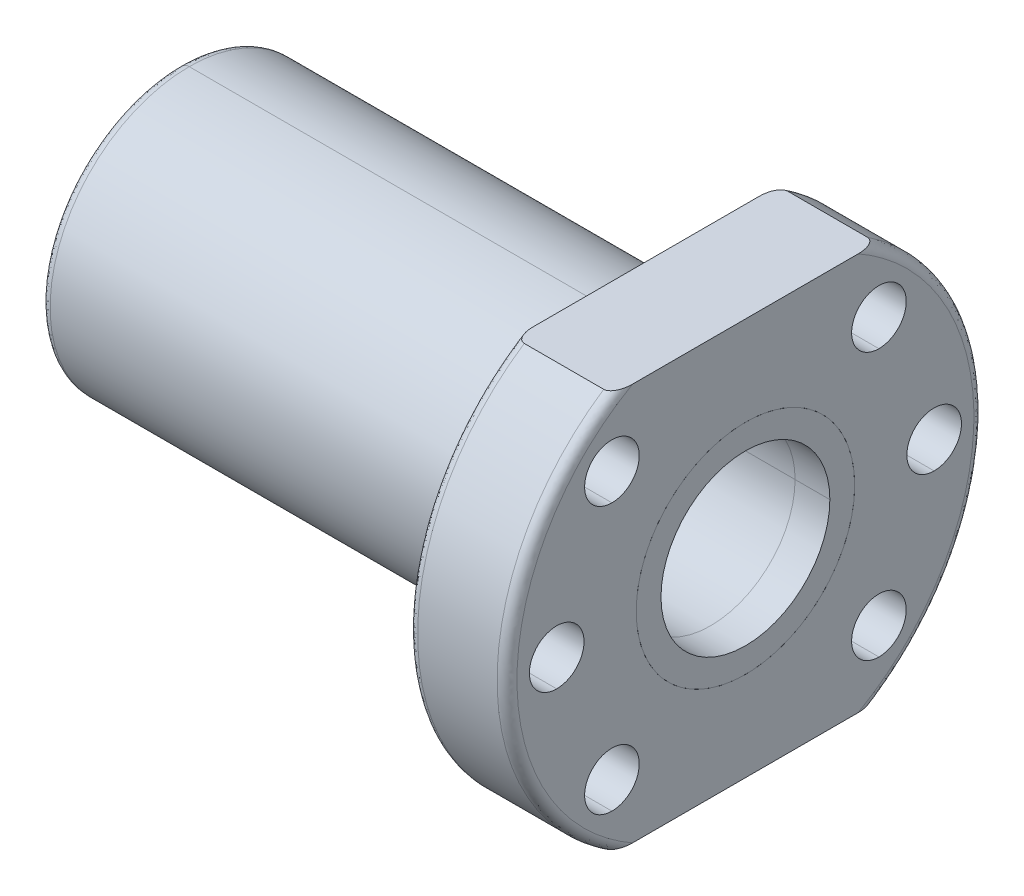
ISO-10303-21;
HEADER;
FILE_DESCRIPTION(('STEP AP214'),'2;1');
FILE_NAME('part.step','',(''),(''),'','','');
FILE_SCHEMA(('AUTOMOTIVE_DESIGN { 1 0 10303 214 1 1 1 1 }'));
ENDSEC;
DATA;
#1=APPLICATION_CONTEXT('core data for automotive mechanical design processes');
#2=APPLICATION_PROTOCOL_DEFINITION('international standard','automotive_design',2000,#1);
#3=PRODUCT_CONTEXT('',#1,'mechanical');
#4=PRODUCT('Part','Part','',(#3));
#5=PRODUCT_RELATED_PRODUCT_CATEGORY('part','',(#4));
#6=PRODUCT_DEFINITION_FORMATION('','',#4);
#7=PRODUCT_DEFINITION_CONTEXT('part definition',#1,'design');
#8=PRODUCT_DEFINITION('design','',#6,#7);
#9=PRODUCT_DEFINITION_SHAPE('','',#8);
#10=(LENGTH_UNIT() NAMED_UNIT(*) SI_UNIT(.MILLI.,.METRE.));
#11=(NAMED_UNIT(*) PLANE_ANGLE_UNIT() SI_UNIT($,.RADIAN.));
#12=(NAMED_UNIT(*) SI_UNIT($,.STERADIAN.) SOLID_ANGLE_UNIT());
#13=UNCERTAINTY_MEASURE_WITH_UNIT(LENGTH_MEASURE(1.E-05),#10,'distance_accuracy_value','');
#14=(GEOMETRIC_REPRESENTATION_CONTEXT(3) GLOBAL_UNCERTAINTY_ASSIGNED_CONTEXT((#13)) GLOBAL_UNIT_ASSIGNED_CONTEXT((#10,
#11,#12)) REPRESENTATION_CONTEXT('',''));
#15=CARTESIAN_POINT('',(0.,0.,0.));
#16=DIRECTION('',(0.,0.,1.));
#17=DIRECTION('',(1.,0.,0.));
#18=AXIS2_PLACEMENT_3D('',#15,#16,#17);
#19=CARTESIAN_POINT('',(-15.,0.,0.));
#20=DIRECTION('',(-1.,0.,0.));
#21=DIRECTION('',(0.,0.,1.));
#22=AXIS2_PLACEMENT_3D('',#19,#20,#21);
#23=CYLINDRICAL_SURFACE('',#22,8.5);
#24=CARTESIAN_POINT('',(-15.,0.,0.));
#25=DIRECTION('',(-1.,0.,0.));
#26=DIRECTION('',(0.,0.,1.));
#27=AXIS2_PLACEMENT_3D('',#24,#25,#26);
#28=CIRCLE('',#27,8.5);
#29=CARTESIAN_POINT('',(-15.,0.,-8.5));
#30=VERTEX_POINT('',#29);
#31=CARTESIAN_POINT('',(-15.,0.,8.5));
#32=VERTEX_POINT('',#31);
#33=EDGE_CURVE('P0_E102',#30,#32,#28,.T.);
#34=ORIENTED_EDGE('',*,*,#33,.F.);
#35=DIRECTION('',(-1.,0.,0.));
#36=VECTOR('',#35,1.);
#37=CARTESIAN_POINT('',(-15.,0.,-8.5));
#38=LINE('',#37,#36);
#39=CARTESIAN_POINT('',(-18.5,0.,-8.5));
#40=VERTEX_POINT('',#39);
#41=EDGE_CURVE('P0_E112',#30,#40,#38,.T.);
#42=ORIENTED_EDGE('',*,*,#41,.T.);
#43=CARTESIAN_POINT('',(-18.5,0.,0.));
#44=DIRECTION('',(-1.,0.,0.));
#45=DIRECTION('',(0.,0.,1.));
#46=AXIS2_PLACEMENT_3D('',#43,#44,#45);
#47=CIRCLE('',#46,8.5);
#48=CARTESIAN_POINT('',(-18.5,0.,8.5));
#49=VERTEX_POINT('',#48);
#50=EDGE_CURVE('P0_E11',#40,#49,#47,.T.);
#51=ORIENTED_EDGE('',*,*,#50,.T.);
#52=DIRECTION('',(-1.,0.,0.));
#53=VECTOR('',#52,1.);
#54=CARTESIAN_POINT('',(-15.,0.,8.5));
#55=LINE('',#54,#53);
#56=EDGE_CURVE('P0_E111',#32,#49,#55,.T.);
#57=ORIENTED_EDGE('',*,*,#56,.F.);
#58=EDGE_LOOP('',(#34,#42,#51,#57));
#59=FACE_BOUND('',#58,.T.);
#60=ADVANCED_FACE('P0_F17',(#59),#23,.F.);
#61=CARTESIAN_POINT('',(-15.,0.,0.));
#62=DIRECTION('',(-1.,0.,0.));
#63=DIRECTION('',(0.,0.,1.));
#64=AXIS2_PLACEMENT_3D('',#61,#62,#63);
#65=CYLINDRICAL_SURFACE('',#64,11.);
#66=CARTESIAN_POINT('',(-15.,0.,0.));
#67=DIRECTION('',(-1.,0.,0.));
#68=DIRECTION('',(0.,0.,1.));
#69=AXIS2_PLACEMENT_3D('',#66,#67,#68);
#70=CIRCLE('',#69,11.);
#71=CARTESIAN_POINT('',(-15.,0.,11.));
#72=VERTEX_POINT('',#71);
#73=CARTESIAN_POINT('',(-15.,0.,-11.));
#74=VERTEX_POINT('',#73);
#75=EDGE_CURVE('P0_E77',#72,#74,#70,.T.);
#76=ORIENTED_EDGE('',*,*,#75,.T.);
#77=DIRECTION('',(-1.,0.,0.));
#78=VECTOR('',#77,1.);
#79=CARTESIAN_POINT('',(-15.,0.,-11.));
#80=LINE('',#79,#78);
#81=CARTESIAN_POINT('',(-18.5,0.,-11.));
#82=VERTEX_POINT('',#81);
#83=EDGE_CURVE('P0_E83',#74,#82,#80,.T.);
#84=ORIENTED_EDGE('',*,*,#83,.T.);
#85=CARTESIAN_POINT('',(-18.5,0.,0.));
#86=DIRECTION('',(1.,0.,0.));
#87=DIRECTION('',(0.,0.,1.));
#88=AXIS2_PLACEMENT_3D('',#85,#86,#87);
#89=CIRCLE('',#88,11.);
#90=CARTESIAN_POINT('',(-18.5,0.,11.));
#91=VERTEX_POINT('',#90);
#92=EDGE_CURVE('P0_E26',#82,#91,#89,.T.);
#93=ORIENTED_EDGE('',*,*,#92,.T.);
#94=DIRECTION('',(-1.,0.,0.));
#95=VECTOR('',#94,1.);
#96=CARTESIAN_POINT('',(-15.,0.,11.));
#97=LINE('',#96,#95);
#98=EDGE_CURVE('P0_E72',#72,#91,#97,.T.);
#99=ORIENTED_EDGE('',*,*,#98,.F.);
#100=EDGE_LOOP('',(#76,#84,#93,#99));
#101=FACE_BOUND('',#100,.T.);
#102=ADVANCED_FACE('P0_F74',(#101),#65,.T.);
#103=CARTESIAN_POINT('',(-18.5,9.75,0.));
#104=DIRECTION('',(1.,0.,0.));
#105=DIRECTION('',(0.,1.,0.));
#106=AXIS2_PLACEMENT_3D('',#103,#104,#105);
#107=PLANE('',#106);
#108=CARTESIAN_POINT('',(-18.5,0.,0.));
#109=DIRECTION('',(-1.,0.,0.));
#110=DIRECTION('',(0.,0.,1.));
#111=AXIS2_PLACEMENT_3D('',#108,#109,#110);
#112=CIRCLE('',#111,8.5);
#113=EDGE_CURVE('P0_E108',#49,#40,#112,.T.);
#114=ORIENTED_EDGE('',*,*,#113,.F.);
#115=ORIENTED_EDGE('',*,*,#50,.F.);
#116=EDGE_LOOP('',(#114,#115));
#117=FACE_BOUND('',#116,.T.);
#118=CARTESIAN_POINT('',(-18.5,0.,0.));
#119=DIRECTION('',(1.,0.,0.));
#120=DIRECTION('',(0.,0.,1.));
#121=AXIS2_PLACEMENT_3D('',#118,#119,#120);
#122=CIRCLE('',#121,11.);
#123=EDGE_CURVE('P0_E82',#91,#82,#122,.T.);
#124=ORIENTED_EDGE('',*,*,#123,.F.);
#125=ORIENTED_EDGE('',*,*,#92,.F.);
#126=EDGE_LOOP('',(#124,#125));
#127=FACE_BOUND('',#126,.T.);
#128=ADVANCED_FACE('P0_F19',(#117,#127),#107,.F.);
#129=CARTESIAN_POINT('',(-15.,0.,0.));
#130=DIRECTION('',(-1.,0.,0.));
#131=DIRECTION('',(0.,0.,1.));
#132=AXIS2_PLACEMENT_3D('',#129,#130,#131);
#133=CYLINDRICAL_SURFACE('',#132,8.5);
#134=ORIENTED_EDGE('',*,*,#41,.F.);
#135=CARTESIAN_POINT('',(-15.,0.,0.));
#136=DIRECTION('',(-1.,0.,0.));
#137=DIRECTION('',(0.,0.,1.));
#138=AXIS2_PLACEMENT_3D('',#135,#136,#137);
#139=CIRCLE('',#138,8.5);
#140=EDGE_CURVE('P0_E90',#32,#30,#139,.T.);
#141=ORIENTED_EDGE('',*,*,#140,.F.);
#142=ORIENTED_EDGE('',*,*,#56,.T.);
#143=ORIENTED_EDGE('',*,*,#113,.T.);
#144=EDGE_LOOP('',(#134,#141,#142,#143));
#145=FACE_BOUND('',#144,.T.);
#146=ADVANCED_FACE('P0_F210',(#145),#133,.F.);
#147=CARTESIAN_POINT('',(-15.,0.,0.));
#148=DIRECTION('',(-1.,0.,0.));
#149=DIRECTION('',(0.,0.,1.));
#150=AXIS2_PLACEMENT_3D('',#147,#148,#149);
#151=CYLINDRICAL_SURFACE('',#150,11.);
#152=ORIENTED_EDGE('',*,*,#83,.F.);
#153=CARTESIAN_POINT('',(-15.,0.,0.));
#154=DIRECTION('',(-1.,0.,0.));
#155=DIRECTION('',(0.,0.,1.));
#156=AXIS2_PLACEMENT_3D('',#153,#154,#155);
#157=CIRCLE('',#156,11.);
#158=EDGE_CURVE('P0_E86',#74,#72,#157,.T.);
#159=ORIENTED_EDGE('',*,*,#158,.T.);
#160=ORIENTED_EDGE('',*,*,#98,.T.);
#161=ORIENTED_EDGE('',*,*,#123,.T.);
#162=EDGE_LOOP('',(#152,#159,#160,#161));
#163=FACE_BOUND('',#162,.T.);
#164=ADVANCED_FACE('P0_F87',(#163),#151,.T.);
#165=CARTESIAN_POINT('',(-15.,9.75,0.));
#166=DIRECTION('',(1.,0.,0.));
#167=DIRECTION('',(0.,1.,0.));
#168=AXIS2_PLACEMENT_3D('',#165,#166,#167);
#169=PLANE('',#168);
#170=ORIENTED_EDGE('',*,*,#140,.T.);
#171=ORIENTED_EDGE('',*,*,#33,.T.);
#172=EDGE_LOOP('',(#170,#171));
#173=FACE_BOUND('',#172,.T.);
#174=ORIENTED_EDGE('',*,*,#75,.F.);
#175=ORIENTED_EDGE('',*,*,#158,.F.);
#176=EDGE_LOOP('',(#174,#175));
#177=FACE_BOUND('',#176,.T.);
#178=ADVANCED_FACE('P0_F92',(#173,#177),#169,.T.);
#179=CLOSED_SHELL('',(#60,#102,#128,#146,#164,#178));
#180=MANIFOLD_SOLID_BREP('P0_B1',#179);
#181=CARTESIAN_POINT('',(-71.,-14.0000000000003,0.));
#182=CARTESIAN_POINT('',(-70.9999999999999,-14.0000000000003,-28.0000000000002));
#183=CARTESIAN_POINT('',(-71.0000000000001,13.9999999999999,-28.0000000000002));
#184=CARTESIAN_POINT('',(-71.,14.,0.));
#185=CARTESIAN_POINT('',(-71.585786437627,-14.0000000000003,0.));
#186=CARTESIAN_POINT('',(-71.585786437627,-14.0000000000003,-28.0000000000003));
#187=CARTESIAN_POINT('',(-71.585786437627,14.,-28.0000000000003));
#188=CARTESIAN_POINT('',(-71.585786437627,13.9999999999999,0.));
#189=CARTESIAN_POINT('',(-72.,-13.5857864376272,0.));
#190=CARTESIAN_POINT('',(-72.0000000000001,-13.5857864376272,-27.1715728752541));
#191=CARTESIAN_POINT('',(-72.0000000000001,13.5857864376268,-27.1715728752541));
#192=CARTESIAN_POINT('',(-72.0000000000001,13.5857864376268,0.));
#193=CARTESIAN_POINT('',(-72.,-13.0000000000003,0.));
#194=CARTESIAN_POINT('',(-72.,-13.0000000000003,-26.0000000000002));
#195=CARTESIAN_POINT('',(-72.,12.9999999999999,-26.0000000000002));
#196=CARTESIAN_POINT('',(-72.,13.,0.));
#197=(BOUNDED_SURFACE() B_SPLINE_SURFACE(3,3,((#181,#182,#183,#184),(#185,#186,#187,#188),(#189,
#190,#191,#192),(#193,#194,#195,#196)),.UNSPECIFIED.,.F.,.F.,
.F.) B_SPLINE_SURFACE_WITH_KNOTS((4,4),(4,4),(0.,1.),(0.,1.),
.UNSPECIFIED.) GEOMETRIC_REPRESENTATION_ITEM() RATIONAL_B_SPLINE_SURFACE(((1.,0.333333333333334,
0.333333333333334,1.),(0.804737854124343,0.268245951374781,0.268245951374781,0.804737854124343),
(0.804737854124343,0.268245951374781,0.268245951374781,0.804737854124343),(1.,0.333333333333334,
0.333333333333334,1.))) REPRESENTATION_ITEM('') SURFACE());
#198=CARTESIAN_POINT('',(-71.,-1.85579310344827E-13,0.));
#199=DIRECTION('',(1.,0.,0.));
#200=DIRECTION('',(0.,1.,0.));
#201=AXIS2_PLACEMENT_3D('',#198,#199,#200);
#202=CIRCLE('',#201,14.);
#203=CARTESIAN_POINT('',(-71.,-14.0000000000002,0.));
#204=VERTEX_POINT('',#203);
#205=CARTESIAN_POINT('',(-71.,13.9999999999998,0.));
#206=VERTEX_POINT('',#205);
#207=EDGE_CURVE('P1_E10',#204,#206,#202,.T.);
#208=CARTESIAN_POINT('',(-71.,-13.0000000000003,0.));
#209=DIRECTION('',(0.,0.,-1.));
#210=DIRECTION('',(0.,-1.,0.));
#211=AXIS2_PLACEMENT_3D('',#208,#209,#210);
#212=CIRCLE('',#211,0.999999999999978);
#213=CARTESIAN_POINT('',(-72.,-13.0000000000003,0.));
#214=VERTEX_POINT('',#213);
#215=EDGE_CURVE('P1_E302',#204,#214,#212,.T.);
#216=CARTESIAN_POINT('',(-72.,-13.0000000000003,0.));
#217=CARTESIAN_POINT('',(-72.,-13.0000000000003,-26.0000000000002));
#218=CARTESIAN_POINT('',(-72.,12.9999999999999,-26.0000000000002));
#219=CARTESIAN_POINT('',(-72.,13.,0.));
#220=(BOUNDED_CURVE() B_SPLINE_CURVE(3,(#216,#217,#218,#219),.UNSPECIFIED.,.F.,
.F.) B_SPLINE_CURVE_WITH_KNOTS((4,4),(0.,1.),
.UNSPECIFIED.) CURVE() GEOMETRIC_REPRESENTATION_ITEM() RATIONAL_B_SPLINE_CURVE((1.,
0.333333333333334,0.333333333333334,1.)) REPRESENTATION_ITEM(''));
#221=CARTESIAN_POINT('',(-72.,13.,0.));
#222=VERTEX_POINT('',#221);
#223=EDGE_CURVE('P1_E754',#214,#222,#220,.T.);
#224=CARTESIAN_POINT('',(-71.,13.,0.));
#225=DIRECTION('',(0.,0.,1.));
#226=DIRECTION('',(0.,1.,0.));
#227=AXIS2_PLACEMENT_3D('',#224,#225,#226);
#228=CIRCLE('',#227,0.999999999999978);
#229=EDGE_CURVE('P1_E307',#206,#222,#228,.T.);
#230=ORIENTED_EDGE('',*,*,#207,.F.);
#231=ORIENTED_EDGE('',*,*,#215,.T.);
#232=ORIENTED_EDGE('',*,*,#223,.T.);
#233=ORIENTED_EDGE('',*,*,#229,.F.);
#234=EDGE_LOOP('',(#230,#231,#232,#233));
#235=FACE_BOUND('',#234,.T.);
#236=ADVANCED_FACE('P1_F16',(#235),#197,.T.);
#237=CARTESIAN_POINT('',(-71.,-1.85579310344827E-13,0.));
#238=DIRECTION('',(1.,0.,0.));
#239=DIRECTION('',(0.,1.,0.));
#240=AXIS2_PLACEMENT_3D('',#237,#238,#239);
#241=CYLINDRICAL_SURFACE('',#240,14.);
#242=DIRECTION('',(1.,0.,0.));
#243=VECTOR('',#242,1.);
#244=CARTESIAN_POINT('',(-71.,-14.0000000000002,0.));
#245=LINE('',#244,#243);
#246=CARTESIAN_POINT('',(-25.,-14.,0.));
#247=VERTEX_POINT('',#246);
#248=EDGE_CURVE('P1_E867',#204,#247,#245,.T.);
#249=ORIENTED_EDGE('',*,*,#248,.F.);
#250=ORIENTED_EDGE('',*,*,#207,.T.);
#251=DIRECTION('',(1.,0.,0.));
#252=VECTOR('',#251,1.);
#253=CARTESIAN_POINT('',(-71.,13.9999999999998,0.));
#254=LINE('',#253,#252);
#255=CARTESIAN_POINT('',(-25.,14.,0.));
#256=VERTEX_POINT('',#255);
#257=EDGE_CURVE('P1_E866',#206,#256,#254,.T.);
#258=ORIENTED_EDGE('',*,*,#257,.T.);
#259=CARTESIAN_POINT('',(-25.,0.,0.));
#260=DIRECTION('',(-1.,0.,0.));
#261=DIRECTION('',(0.,1.,0.));
#262=AXIS2_PLACEMENT_3D('',#259,#260,#261);
#263=CIRCLE('',#262,14.);
#264=EDGE_CURVE('P1_E638',#256,#247,#263,.T.);
#265=ORIENTED_EDGE('',*,*,#264,.T.);
#266=EDGE_LOOP('',(#249,#250,#258,#265));
#267=FACE_BOUND('',#266,.T.);
#268=ADVANCED_FACE('P1_F900',(#267),#241,.T.);
#269=CARTESIAN_POINT('',(-15.,13.44,13.44));
#270=DIRECTION('',(-1.,0.,0.));
#271=DIRECTION('',(0.,-1.,0.));
#272=AXIS2_PLACEMENT_3D('',#269,#270,#271);
#273=CYLINDRICAL_SURFACE('',#272,2.75);
#274=CARTESIAN_POINT('',(-15.,13.44,13.44));
#275=DIRECTION('',(-1.,0.,0.));
#276=DIRECTION('',(0.,-1.,0.));
#277=AXIS2_PLACEMENT_3D('',#274,#275,#276);
#278=CIRCLE('',#277,2.75);
#279=CARTESIAN_POINT('',(-15.,16.19,13.44));
#280=VERTEX_POINT('',#279);
#281=CARTESIAN_POINT('',(-15.,10.69,13.44));
#282=VERTEX_POINT('',#281);
#283=EDGE_CURVE('P1_E56',#280,#282,#278,.T.);
#284=ORIENTED_EDGE('',*,*,#283,.F.);
#285=DIRECTION('',(-1.,0.,0.));
#286=VECTOR('',#285,1.);
#287=CARTESIAN_POINT('',(-15.,16.19,13.44));
#288=LINE('',#287,#286);
#289=CARTESIAN_POINT('',(-25.,16.19,13.44));
#290=VERTEX_POINT('',#289);
#291=EDGE_CURVE('P1_E259',#280,#290,#288,.T.);
#292=ORIENTED_EDGE('',*,*,#291,.T.);
#293=CARTESIAN_POINT('',(-25.,13.4399999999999,13.44));
#294=DIRECTION('',(-1.,0.,0.));
#295=DIRECTION('',(0.,-1.,0.));
#296=AXIS2_PLACEMENT_3D('',#293,#294,#295);
#297=CIRCLE('',#296,2.75);
#298=CARTESIAN_POINT('',(-25.,10.6899999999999,13.44));
#299=VERTEX_POINT('',#298);
#300=EDGE_CURVE('P1_E43',#290,#299,#297,.T.);
#301=ORIENTED_EDGE('',*,*,#300,.T.);
#302=DIRECTION('',(-1.,0.,0.));
#303=VECTOR('',#302,1.);
#304=CARTESIAN_POINT('',(-15.,10.69,13.44));
#305=LINE('',#304,#303);
#306=EDGE_CURVE('P1_E261',#282,#299,#305,.T.);
#307=ORIENTED_EDGE('',*,*,#306,.F.);
#308=EDGE_LOOP('',(#284,#292,#301,#307));
#309=FACE_BOUND('',#308,.T.);
#310=ADVANCED_FACE('P1_F257',(#309),#273,.F.);
#311=CARTESIAN_POINT('',(-15.,-13.44,13.44));
#312=DIRECTION('',(-1.,0.,0.));
#313=DIRECTION('',(0.,-1.,0.));
#314=AXIS2_PLACEMENT_3D('',#311,#312,#313);
#315=CYLINDRICAL_SURFACE('',#314,2.75);
#316=CARTESIAN_POINT('',(-15.,-13.44,13.44));
#317=DIRECTION('',(-1.,0.,0.));
#318=DIRECTION('',(0.,-1.,0.));
#319=AXIS2_PLACEMENT_3D('',#316,#317,#318);
#320=CIRCLE('',#319,2.75);
#321=CARTESIAN_POINT('',(-15.,-10.69,13.44));
#322=VERTEX_POINT('',#321);
#323=CARTESIAN_POINT('',(-15.,-16.19,13.44));
#324=VERTEX_POINT('',#323);
#325=EDGE_CURVE('P1_E264',#322,#324,#320,.T.);
#326=ORIENTED_EDGE('',*,*,#325,.F.);
#327=DIRECTION('',(-1.,0.,0.));
#328=VECTOR('',#327,1.);
#329=CARTESIAN_POINT('',(-15.,-10.69,13.44));
#330=LINE('',#329,#328);
#331=CARTESIAN_POINT('',(-25.,-10.6900000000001,13.44));
#332=VERTEX_POINT('',#331);
#333=EDGE_CURVE('P1_E289',#322,#332,#330,.T.);
#334=ORIENTED_EDGE('',*,*,#333,.T.);
#335=CARTESIAN_POINT('',(-25.,-13.4400000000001,13.44));
#336=DIRECTION('',(-1.,0.,0.));
#337=DIRECTION('',(0.,-1.,0.));
#338=AXIS2_PLACEMENT_3D('',#335,#336,#337);
#339=CIRCLE('',#338,2.75);
#340=CARTESIAN_POINT('',(-25.,-16.19,13.44));
#341=VERTEX_POINT('',#340);
#342=EDGE_CURVE('P1_E324',#332,#341,#339,.T.);
#343=ORIENTED_EDGE('',*,*,#342,.T.);
#344=DIRECTION('',(-1.,0.,0.));
#345=VECTOR('',#344,1.);
#346=CARTESIAN_POINT('',(-15.,-16.19,13.44));
#347=LINE('',#346,#345);
#348=EDGE_CURVE('P1_E283',#324,#341,#347,.T.);
#349=ORIENTED_EDGE('',*,*,#348,.F.);
#350=EDGE_LOOP('',(#326,#334,#343,#349));
#351=FACE_BOUND('',#350,.T.);
#352=ADVANCED_FACE('P1_F1429',(#351),#315,.F.);
#353=CARTESIAN_POINT('',(-15.,-13.44,-13.44));
#354=DIRECTION('',(-1.,0.,0.));
#355=DIRECTION('',(0.,-1.,0.));
#356=AXIS2_PLACEMENT_3D('',#353,#354,#355);
#357=CYLINDRICAL_SURFACE('',#356,2.75);
#358=CARTESIAN_POINT('',(-15.,-13.44,-13.44));
#359=DIRECTION('',(-1.,0.,0.));
#360=DIRECTION('',(0.,-1.,0.));
#361=AXIS2_PLACEMENT_3D('',#358,#359,#360);
#362=CIRCLE('',#361,2.75);
#363=CARTESIAN_POINT('',(-15.,-10.69,-13.44));
#364=VERTEX_POINT('',#363);
#365=CARTESIAN_POINT('',(-15.,-16.19,-13.44));
#366=VERTEX_POINT('',#365);
#367=EDGE_CURVE('P1_E337',#364,#366,#362,.T.);
#368=ORIENTED_EDGE('',*,*,#367,.F.);
#369=DIRECTION('',(-1.,0.,0.));
#370=VECTOR('',#369,1.);
#371=CARTESIAN_POINT('',(-15.,-10.69,-13.44));
#372=LINE('',#371,#370);
#373=CARTESIAN_POINT('',(-25.,-10.6900000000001,-13.44));
#374=VERTEX_POINT('',#373);
#375=EDGE_CURVE('P1_E807',#364,#374,#372,.T.);
#376=ORIENTED_EDGE('',*,*,#375,.T.);
#377=CARTESIAN_POINT('',(-25.,-13.4400000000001,-13.44));
#378=DIRECTION('',(-1.,0.,0.));
#379=DIRECTION('',(0.,-1.,0.));
#380=AXIS2_PLACEMENT_3D('',#377,#378,#379);
#381=CIRCLE('',#380,2.75);
#382=CARTESIAN_POINT('',(-25.,-16.19,-13.44));
#383=VERTEX_POINT('',#382);
#384=EDGE_CURVE('P1_E321',#374,#383,#381,.T.);
#385=ORIENTED_EDGE('',*,*,#384,.T.);
#386=DIRECTION('',(-1.,0.,0.));
#387=VECTOR('',#386,1.);
#388=CARTESIAN_POINT('',(-15.,-16.19,-13.44));
#389=LINE('',#388,#387);
#390=EDGE_CURVE('P1_E814',#366,#383,#389,.T.);
#391=ORIENTED_EDGE('',*,*,#390,.F.);
#392=EDGE_LOOP('',(#368,#376,#385,#391));
#393=FACE_BOUND('',#392,.T.);
#394=ADVANCED_FACE('P1_F830',(#393),#357,.F.);
#395=CARTESIAN_POINT('',(-15.,13.44,-13.44));
#396=DIRECTION('',(-1.,0.,0.));
#397=DIRECTION('',(0.,-1.,0.));
#398=AXIS2_PLACEMENT_3D('',#395,#396,#397);
#399=CYLINDRICAL_SURFACE('',#398,2.75);
#400=CARTESIAN_POINT('',(-15.,13.44,-13.44));
#401=DIRECTION('',(-1.,0.,0.));
#402=DIRECTION('',(0.,-1.,0.));
#403=AXIS2_PLACEMENT_3D('',#400,#401,#402);
#404=CIRCLE('',#403,2.75);
#405=CARTESIAN_POINT('',(-15.,16.19,-13.44));
#406=VERTEX_POINT('',#405);
#407=CARTESIAN_POINT('',(-15.,10.69,-13.44));
#408=VERTEX_POINT('',#407);
#409=EDGE_CURVE('P1_E334',#406,#408,#404,.T.);
#410=ORIENTED_EDGE('',*,*,#409,.F.);
#411=DIRECTION('',(-1.,0.,0.));
#412=VECTOR('',#411,1.);
#413=CARTESIAN_POINT('',(-15.,16.19,-13.44));
#414=LINE('',#413,#412);
#415=CARTESIAN_POINT('',(-25.,16.19,-13.44));
#416=VERTEX_POINT('',#415);
#417=EDGE_CURVE('P1_E746',#406,#416,#414,.T.);
#418=ORIENTED_EDGE('',*,*,#417,.T.);
#419=CARTESIAN_POINT('',(-25.,13.4399999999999,-13.44));
#420=DIRECTION('',(-1.,0.,0.));
#421=DIRECTION('',(0.,-1.,0.));
#422=AXIS2_PLACEMENT_3D('',#419,#420,#421);
#423=CIRCLE('',#422,2.75);
#424=CARTESIAN_POINT('',(-25.,10.6899999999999,-13.44));
#425=VERTEX_POINT('',#424);
#426=EDGE_CURVE('P1_E318',#416,#425,#423,.T.);
#427=ORIENTED_EDGE('',*,*,#426,.T.);
#428=DIRECTION('',(-1.,0.,0.));
#429=VECTOR('',#428,1.);
#430=CARTESIAN_POINT('',(-15.,10.69,-13.44));
#431=LINE('',#430,#429);
#432=EDGE_CURVE('P1_E745',#408,#425,#431,.T.);
#433=ORIENTED_EDGE('',*,*,#432,.F.);
#434=EDGE_LOOP('',(#410,#418,#427,#433));
#435=FACE_BOUND('',#434,.T.);
#436=ADVANCED_FACE('P1_F1384',(#435),#399,.F.);
#437=CARTESIAN_POINT('',(-15.,0.,19.));
#438=DIRECTION('',(-1.,0.,0.));
#439=DIRECTION('',(0.,-1.,0.));
#440=AXIS2_PLACEMENT_3D('',#437,#438,#439);
#441=CYLINDRICAL_SURFACE('',#440,2.75);
#442=CARTESIAN_POINT('',(-15.,0.,19.));
#443=DIRECTION('',(-1.,0.,0.));
#444=DIRECTION('',(0.,-1.,0.));
#445=AXIS2_PLACEMENT_3D('',#442,#443,#444);
#446=CIRCLE('',#445,2.75);
#447=CARTESIAN_POINT('',(-15.,2.74999999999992,19.));
#448=VERTEX_POINT('',#447);
#449=CARTESIAN_POINT('',(-15.,-2.75000000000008,19.));
#450=VERTEX_POINT('',#449);
#451=EDGE_CURVE('P1_E330',#448,#450,#446,.T.);
#452=ORIENTED_EDGE('',*,*,#451,.F.);
#453=DIRECTION('',(-1.,0.,0.));
#454=VECTOR('',#453,1.);
#455=CARTESIAN_POINT('',(-15.,2.74999999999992,19.));
#456=LINE('',#455,#454);
#457=CARTESIAN_POINT('',(-25.,2.74999999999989,19.));
#458=VERTEX_POINT('',#457);
#459=EDGE_CURVE('P1_E785',#448,#458,#456,.T.);
#460=ORIENTED_EDGE('',*,*,#459,.T.);
#461=CARTESIAN_POINT('',(-25.,-1.04200487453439E-13,19.));
#462=DIRECTION('',(-1.,0.,0.));
#463=DIRECTION('',(0.,-1.,0.));
#464=AXIS2_PLACEMENT_3D('',#461,#462,#463);
#465=CIRCLE('',#464,2.75);
#466=CARTESIAN_POINT('',(-25.,-2.7500000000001,19.));
#467=VERTEX_POINT('',#466);
#468=EDGE_CURVE('P1_E314',#458,#467,#465,.T.);
#469=ORIENTED_EDGE('',*,*,#468,.T.);
#470=DIRECTION('',(-1.,0.,0.));
#471=VECTOR('',#470,1.);
#472=CARTESIAN_POINT('',(-15.,-2.75000000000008,19.));
#473=LINE('',#472,#471);
#474=EDGE_CURVE('P1_E792',#450,#467,#473,.T.);
#475=ORIENTED_EDGE('',*,*,#474,.F.);
#476=EDGE_LOOP('',(#452,#460,#469,#475));
#477=FACE_BOUND('',#476,.T.);
#478=ADVANCED_FACE('P1_F1379',(#477),#441,.F.);
#479=CARTESIAN_POINT('',(-15.,0.,-19.));
#480=DIRECTION('',(-1.,0.,0.));
#481=DIRECTION('',(0.,-1.,0.));
#482=AXIS2_PLACEMENT_3D('',#479,#480,#481);
#483=CYLINDRICAL_SURFACE('',#482,2.75);
#484=CARTESIAN_POINT('',(-15.,0.,-19.));
#485=DIRECTION('',(-1.,0.,0.));
#486=DIRECTION('',(0.,-1.,0.));
#487=AXIS2_PLACEMENT_3D('',#484,#485,#486);
#488=CIRCLE('',#487,2.75);
#489=CARTESIAN_POINT('',(-15.,2.74999999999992,-19.));
#490=VERTEX_POINT('',#489);
#491=CARTESIAN_POINT('',(-15.,-2.75000000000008,-19.));
#492=VERTEX_POINT('',#491);
#493=EDGE_CURVE('P1_E327',#490,#492,#488,.T.);
#494=ORIENTED_EDGE('',*,*,#493,.F.);
#495=DIRECTION('',(-1.,0.,0.));
#496=VECTOR('',#495,1.);
#497=CARTESIAN_POINT('',(-15.,2.74999999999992,-19.));
#498=LINE('',#497,#496);
#499=CARTESIAN_POINT('',(-25.,2.74999999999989,-19.));
#500=VERTEX_POINT('',#499);
#501=EDGE_CURVE('P1_E775',#490,#500,#498,.T.);
#502=ORIENTED_EDGE('',*,*,#501,.T.);
#503=CARTESIAN_POINT('',(-25.,-1.03549966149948E-13,-19.));
#504=DIRECTION('',(-1.,0.,0.));
#505=DIRECTION('',(0.,-1.,0.));
#506=AXIS2_PLACEMENT_3D('',#503,#504,#505);
#507=CIRCLE('',#506,2.75);
#508=CARTESIAN_POINT('',(-25.,-2.7500000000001,-19.));
#509=VERTEX_POINT('',#508);
#510=EDGE_CURVE('P1_E311',#500,#509,#507,.T.);
#511=ORIENTED_EDGE('',*,*,#510,.T.);
#512=DIRECTION('',(-1.,0.,0.));
#513=VECTOR('',#512,1.);
#514=CARTESIAN_POINT('',(-15.,-2.75000000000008,-19.));
#515=LINE('',#514,#513);
#516=EDGE_CURVE('P1_E780',#492,#509,#515,.T.);
#517=ORIENTED_EDGE('',*,*,#516,.F.);
#518=EDGE_LOOP('',(#494,#502,#511,#517));
#519=FACE_BOUND('',#518,.T.);
#520=ADVANCED_FACE('P1_F887',(#519),#483,.F.);
#521=CARTESIAN_POINT('',(-68.5,-1.88193103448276E-13,0.));
#522=DIRECTION('',(-1.,0.,0.));
#523=DIRECTION('',(0.,0.,1.));
#524=AXIS2_PLACEMENT_3D('',#521,#522,#523);
#525=CYLINDRICAL_SURFACE('',#524,8.5);
#526=DIRECTION('',(-1.,0.,0.));
#527=VECTOR('',#526,1.);
#528=CARTESIAN_POINT('',(-68.5,-1.87152153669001E-13,-8.5));
#529=LINE('',#528,#527);
#530=CARTESIAN_POINT('',(-18.5,-1.87152153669E-13,-8.5));
#531=VERTEX_POINT('',#530);
#532=CARTESIAN_POINT('',(-72.,-1.87152153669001E-13,-8.5));
#533=VERTEX_POINT('',#532);
#534=EDGE_CURVE('P1_E857',#531,#533,#529,.T.);
#535=ORIENTED_EDGE('',*,*,#534,.F.);
#536=CARTESIAN_POINT('',(-18.5,0.,0.));
#537=DIRECTION('',(-1.,0.,0.));
#538=DIRECTION('',(0.,1.,0.));
#539=AXIS2_PLACEMENT_3D('',#536,#537,#538);
#540=CIRCLE('',#539,8.5);
#541=CARTESIAN_POINT('',(-18.5,-1.88193103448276E-13,8.5));
#542=VERTEX_POINT('',#541);
#543=EDGE_CURVE('P1_E729',#542,#531,#540,.T.);
#544=ORIENTED_EDGE('',*,*,#543,.F.);
#545=DIRECTION('',(-1.,0.,0.));
#546=VECTOR('',#545,1.);
#547=CARTESIAN_POINT('',(-68.5,-1.88193103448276E-13,8.5));
#548=LINE('',#547,#546);
#549=CARTESIAN_POINT('',(-72.,-1.88193103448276E-13,8.5));
#550=VERTEX_POINT('',#549);
#551=EDGE_CURVE('P1_E659',#542,#550,#548,.T.);
#552=ORIENTED_EDGE('',*,*,#551,.T.);
#553=CARTESIAN_POINT('',(-72.,-1.88193103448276E-13,0.));
#554=DIRECTION('',(-1.,0.,0.));
#555=DIRECTION('',(0.,0.,1.));
#556=AXIS2_PLACEMENT_3D('',#553,#554,#555);
#557=CIRCLE('',#556,8.5);
#558=EDGE_CURVE('P1_E769',#550,#533,#557,.T.);
#559=ORIENTED_EDGE('',*,*,#558,.T.);
#560=EDGE_LOOP('',(#535,#544,#552,#559));
#561=FACE_BOUND('',#560,.T.);
#562=ADVANCED_FACE('P1_F1538',(#561),#525,.F.);
#563=CARTESIAN_POINT('',(-87.,-2.274E-13,0.));
#564=DIRECTION('',(1.,0.,0.));
#565=DIRECTION('',(0.,1.,0.));
#566=AXIS2_PLACEMENT_3D('',#563,#564,#565);
#567=CYLINDRICAL_SURFACE('',#566,11.);
#568=CARTESIAN_POINT('',(-18.5,0.,0.));
#569=DIRECTION('',(1.,0.,0.));
#570=DIRECTION('',(0.,1.,0.));
#571=AXIS2_PLACEMENT_3D('',#568,#569,#570);
#572=CIRCLE('',#571,11.);
#573=CARTESIAN_POINT('',(-18.5,-11.,0.));
#574=VERTEX_POINT('',#573);
#575=CARTESIAN_POINT('',(-18.5,11.,0.));
#576=VERTEX_POINT('',#575);
#577=EDGE_CURVE('P1_E721',#574,#576,#572,.T.);
#578=ORIENTED_EDGE('',*,*,#577,.F.);
#579=DIRECTION('',(1.,0.,0.));
#580=VECTOR('',#579,1.);
#581=CARTESIAN_POINT('',(-87.,-11.0000000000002,0.));
#582=LINE('',#581,#580);
#583=CARTESIAN_POINT('',(-15.,-11.,0.));
#584=VERTEX_POINT('',#583);
#585=EDGE_CURVE('P1_E735',#574,#584,#582,.T.);
#586=ORIENTED_EDGE('',*,*,#585,.T.);
#587=CARTESIAN_POINT('',(-15.,0.,0.));
#588=DIRECTION('',(-1.,0.,0.));
#589=DIRECTION('',(0.,1.,0.));
#590=AXIS2_PLACEMENT_3D('',#587,#588,#589);
#591=CIRCLE('',#590,11.);
#592=CARTESIAN_POINT('',(-15.,11.,0.));
#593=VERTEX_POINT('',#592);
#594=EDGE_CURVE('P1_E29',#593,#584,#591,.T.);
#595=ORIENTED_EDGE('',*,*,#594,.F.);
#596=DIRECTION('',(1.,0.,0.));
#597=VECTOR('',#596,1.);
#598=CARTESIAN_POINT('',(-87.,10.9999999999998,0.));
#599=LINE('',#598,#597);
#600=EDGE_CURVE('P1_E740',#576,#593,#599,.T.);
#601=ORIENTED_EDGE('',*,*,#600,.F.);
#602=EDGE_LOOP('',(#578,#586,#595,#601));
#603=FACE_BOUND('',#602,.T.);
#604=ADVANCED_FACE('P1_F1527',(#603),#567,.F.);
#605=CARTESIAN_POINT('',(-15.,20.1420929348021,11.1038773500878));
#606=CARTESIAN_POINT('',(-15.,10.2475369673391,29.0522983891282));
#607=CARTESIAN_POINT('',(-15.,-10.2475369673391,29.0522983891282));
#608=CARTESIAN_POINT('',(-15.,-20.1420929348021,11.1038773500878));
#609=CARTESIAN_POINT('',(-15.0000000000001,20.6550914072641,11.3866817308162));
#610=CARTESIAN_POINT('',(-15.,10.5085312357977,29.792230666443));
#611=CARTESIAN_POINT('',(-15.,-10.5085312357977,29.792230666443));
#612=CARTESIAN_POINT('',(-15.,-20.6550914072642,11.3866817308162));
#613=CARTESIAN_POINT('',(-15.4142135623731,21.0178361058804,11.5866546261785));
#614=CARTESIAN_POINT('',(-15.4142135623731,10.6930820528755,30.3154417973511));
#615=CARTESIAN_POINT('',(-15.414213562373,-10.6930820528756,30.3154417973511));
#616=CARTESIAN_POINT('',(-15.414213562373,-21.0178361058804,11.5866546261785));
#617=CARTESIAN_POINT('',(-16.,21.0178361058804,11.5866546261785));
#618=CARTESIAN_POINT('',(-16.,10.6930820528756,30.3154417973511));
#619=CARTESIAN_POINT('',(-15.9999999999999,-10.6930820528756,30.3154417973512));
#620=CARTESIAN_POINT('',(-16.,-21.0178361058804,11.5866546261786));
#621=(BOUNDED_SURFACE() B_SPLINE_SURFACE(3,3,((#605,#606,#607,#608),(#609,#610,#611,#612),(#613,
#614,#615,#616),(#617,#618,#619,#620)),.UNSPECIFIED.,.F.,.F.,
.F.) B_SPLINE_SURFACE_WITH_KNOTS((4,4),(4,4),(0.,1.),(0.,1.),
.UNSPECIFIED.) GEOMETRIC_REPRESENTATION_ITEM() RATIONAL_B_SPLINE_SURFACE(((1.,0.655184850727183,
0.655184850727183,1.),(0.804737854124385,0.527252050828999,0.527252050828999,0.804737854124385),
(0.804737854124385,0.527252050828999,0.527252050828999,0.804737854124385),(1.,0.655184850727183,
0.655184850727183,1.))) REPRESENTATION_ITEM('') SURFACE());
#622=CARTESIAN_POINT('',(-16.,0.,0.));
#623=DIRECTION('',(-1.,0.,0.));
#624=DIRECTION('',(0.,1.,0.));
#625=AXIS2_PLACEMENT_3D('',#622,#623,#624);
#626=CIRCLE('',#625,24.);
#627=CARTESIAN_POINT('',(-16.,-20.,13.2664991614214));
#628=VERTEX_POINT('',#627);
#629=CARTESIAN_POINT('',(-16.,20.,13.2664991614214));
#630=VERTEX_POINT('',#629);
#631=EDGE_CURVE('P1_E533',#628,#630,#626,.T.);
#632=CARTESIAN_POINT('',(-16.,-20.,13.2664991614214));
#633=CARTESIAN_POINT('',(-15.9945772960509,-20.0000000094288,13.2664992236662));
#634=CARTESIAN_POINT('',(-15.9891546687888,-20.0000023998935,13.2664157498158));
#635=CARTESIAN_POINT('',(-15.9782907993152,-20.0000111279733,13.2660828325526));
#636=CARTESIAN_POINT('',(-15.9728495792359,-20.0000174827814,13.2658326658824));
#637=CARTESIAN_POINT('',(-15.9619506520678,-20.0000333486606,13.2651658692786));
#638=CARTESIAN_POINT('',(-15.9564929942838,-20.0000428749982,13.2647484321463));
#639=CARTESIAN_POINT('',(-15.9455635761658,-20.0000643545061,13.2637467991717));
#640=CARTESIAN_POINT('',(-15.9400918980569,-20.0000763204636,13.2631617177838));
#641=CARTESIAN_POINT('',(-15.9236083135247,-20.0001149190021,13.261149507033));
#642=CARTESIAN_POINT('',(-15.9126260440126,-20.0001440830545,13.2594714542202));
#643=CARTESIAN_POINT('',(-15.8906318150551,-20.0002042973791,13.255448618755));
#644=CARTESIAN_POINT('',(-15.8796214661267,-20.0002353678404,13.2530951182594));
#645=CARTESIAN_POINT('',(-15.8575883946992,-20.0002952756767,13.2477204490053));
#646=CARTESIAN_POINT('',(-15.8465680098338,-20.0003240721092,13.2446897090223));
#647=CARTESIAN_POINT('',(-15.8245338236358,-20.0003761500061,13.2379603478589));
#648=CARTESIAN_POINT('',(-15.8135231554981,-20.0003993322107,13.2342514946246));
#649=CARTESIAN_POINT('',(-15.7915273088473,-20.000437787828,13.2261663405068));
#650=CARTESIAN_POINT('',(-15.7805460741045,-20.0004529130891,13.2217793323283));
#651=CARTESIAN_POINT('',(-15.7586283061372,-20.0004737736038,13.2123390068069));
#652=CARTESIAN_POINT('',(-15.7476965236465,-20.000479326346,13.207274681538));
#653=CARTESIAN_POINT('',(-15.7258969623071,-20.0004804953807,13.1964815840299));
#654=CARTESIAN_POINT('',(-15.7150347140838,-20.0004759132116,13.1907416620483));
#655=CARTESIAN_POINT('',(-15.6933935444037,-20.0004572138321,13.178599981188));
#656=CARTESIAN_POINT('',(-15.6826208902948,-20.0004429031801,13.1721870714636));
#657=CARTESIAN_POINT('',(-15.6611781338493,-20.0004060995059,13.1587027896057));
#658=CARTESIAN_POINT('',(-15.6505149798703,-20.0003834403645,13.1516203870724));
#659=CARTESIAN_POINT('',(-15.6293102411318,-20.0003322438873,13.1368012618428));
#660=CARTESIAN_POINT('',(-15.618776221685,-20.0003035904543,13.1290537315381));
#661=CARTESIAN_POINT('',(-15.5978484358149,-20.0002436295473,13.1129092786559));
#662=CARTESIAN_POINT('',(-15.5874627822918,-20.0002122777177,13.1045018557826));
#663=CARTESIAN_POINT('',(-15.5668499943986,-20.0001511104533,13.0870432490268));
#664=CARTESIAN_POINT('',(-15.556631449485,-20.0001213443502,13.0779819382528));
#665=CARTESIAN_POINT('',(-15.5363704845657,-20.0000682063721,13.0592221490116));
#666=CARTESIAN_POINT('',(-15.5263370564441,-20.0000449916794,13.0495139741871));
#667=CARTESIAN_POINT('',(-15.506463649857,-20.0000114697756,13.0294669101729));
#668=CARTESIAN_POINT('',(-15.4966330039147,-20.0000014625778,13.0191187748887));
#669=CARTESIAN_POINT('',(-15.4801164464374,-19.9999989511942,13.0010197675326));
#670=CARTESIAN_POINT('',(-15.4733276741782,-20.0000022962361,12.9933623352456));
#671=CARTESIAN_POINT('',(-15.4597867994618,-20.0000133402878,12.9776669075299));
#672=CARTESIAN_POINT('',(-15.4530401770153,-20.0000211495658,12.9696241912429));
#673=CARTESIAN_POINT('',(-15.4326144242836,-20.0000488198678,12.9446149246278));
#674=CARTESIAN_POINT('',(-15.4192878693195,-20.0000726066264,12.9273589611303));
#675=CARTESIAN_POINT('',(-15.3928621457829,-20.000116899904,12.8913479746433));
#676=CARTESIAN_POINT('',(-15.3798067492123,-20.0001371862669,12.8725610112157));
#677=CARTESIAN_POINT('',(-15.3539923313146,-20.0001664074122,12.8334943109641));
#678=CARTESIAN_POINT('',(-15.3412766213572,-20.0001747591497,12.8131860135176));
#679=CARTESIAN_POINT('',(-15.3162127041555,-20.000176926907,12.7710897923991));
#680=CARTESIAN_POINT('',(-15.3039072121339,-20.0001700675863,12.7492765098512));
#681=CARTESIAN_POINT('',(-15.2797343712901,-20.000143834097,12.7041880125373));
#682=CARTESIAN_POINT('',(-15.2679089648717,-20.0001239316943,12.6808903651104));
#683=CARTESIAN_POINT('',(-15.2447664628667,-20.0000802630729,12.6328559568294));
#684=CARTESIAN_POINT('',(-15.2334904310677,-20.0000563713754,12.6080994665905));
#685=CARTESIAN_POINT('',(-15.2115122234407,-20.0000150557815,12.5571751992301));
#686=CARTESIAN_POINT('',(-15.2008500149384,-19.9999979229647,12.5309901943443));
#687=CARTESIAN_POINT('',(-15.1833831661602,-20.0000014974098,12.4855903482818));
#688=CARTESIAN_POINT('',(-15.1763323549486,-20.0000129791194,12.4664695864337));
#689=CARTESIAN_POINT('',(-15.1623425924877,-20.000046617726,12.4269447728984));
#690=CARTESIAN_POINT('',(-15.155433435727,-20.0000693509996,12.4065302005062));
#691=CARTESIAN_POINT('',(-15.1344310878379,-20.0001340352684,12.3417305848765));
#692=CARTESIAN_POINT('',(-15.1213084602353,-20.0001676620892,12.2970283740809));
#693=CARTESIAN_POINT('',(-15.0961482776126,-20.0001660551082,12.202657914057));
#694=CARTESIAN_POINT('',(-15.0843400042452,-20.0001238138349,12.1529291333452));
#695=CARTESIAN_POINT('',(-15.062343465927,-20.0000681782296,12.0486564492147));
#696=CARTESIAN_POINT('',(-15.0523807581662,-20.0000575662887,11.9940651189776));
#697=CARTESIAN_POINT('',(-15.0361911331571,-19.9999493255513,11.8910254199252));
#698=CARTESIAN_POINT('',(-15.0296597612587,-19.9998622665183,11.842624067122));
#699=CARTESIAN_POINT('',(-15.0185966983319,-19.9995894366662,11.745719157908));
#700=CARTESIAN_POINT('',(-15.0140599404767,-19.9994039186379,11.6972161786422));
#701=CARTESIAN_POINT('',(-15.0069068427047,-19.9991724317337,11.6002179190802));
#702=CARTESIAN_POINT('',(-15.0042847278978,-19.9991260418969,11.5517230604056));
#703=CARTESIAN_POINT('',(-15.0008345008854,-19.9993162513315,11.4548328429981));
#704=CARTESIAN_POINT('',(-15.0000003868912,-19.9995518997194,11.4064376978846));
#705=CARTESIAN_POINT('',(-15.0000000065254,-19.9999999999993,11.3580480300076));
#706=B_SPLINE_CURVE_WITH_KNOTS('',3,(#632,#633,#634,#635,#636,#637,#638,#639,#640,#641,#642,
#643,#644,#645,#646,#647,#648,#649,#650,#651,#652,#653,#654,#655,#656,#657,#658,#659,#660,#661,
#662,#663,#664,#665,#666,#667,#668,#669,#670,#671,#672,#673,#674,#675,#676,#677,#678,#679,#680,
#681,#682,#683,#684,#685,#686,#687,#688,#689,#690,#691,#692,#693,#694,#695,#696,#697,#698,#699,
#700,#701,#702,#703,#704,#705),.UNSPECIFIED.,.F.,.F.,(4,2,2,2,2,2,2,2,2,2,2,2,2,2,2,2,2,2,2,2,2,
2,2,2,2,2,2,2,2,2,2,2,2,2,2,2,4),(0.,0.0162673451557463,0.0326057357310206,0.0490239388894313,
0.0655305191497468,0.0988383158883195,0.13259699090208,0.166866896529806,0.201704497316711,
0.237162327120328,0.27328901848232,0.310129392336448,0.347724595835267,0.386112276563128,
0.425326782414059,0.465399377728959,0.506358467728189,0.548229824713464,0.591036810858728,
0.621733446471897,0.653223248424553,0.718599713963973,0.787206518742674,0.859062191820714,
0.934171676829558,1.01252837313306,1.09411592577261,1.17890981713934,1.24004079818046,
1.3046901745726,1.44438455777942,1.59765078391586,1.76405178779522,1.91053125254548,
2.05663644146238,2.20229911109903,2.34747206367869),.UNSPECIFIED.);
#707=CARTESIAN_POINT('',(-15.,-20.,11.358048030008));
#708=VERTEX_POINT('',#707);
#709=EDGE_CURVE('P1_E645',#628,#708,#706,.T.);
#710=CARTESIAN_POINT('',(-15.,20.,11.3580296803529));
#711=CARTESIAN_POINT('',(-15.,19.8732338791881,11.5813701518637));
#712=CARTESIAN_POINT('',(-15.,19.7425396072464,11.8026819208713));
#713=CARTESIAN_POINT('',(-15.,19.4734777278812,12.2413519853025));
#714=CARTESIAN_POINT('',(-15.,19.3367871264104,12.4562188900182));
#715=CARTESIAN_POINT('',(-15.,18.9015618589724,13.1152590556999));
#716=CARTESIAN_POINT('',(-15.,18.5974090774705,13.5432953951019));
#717=CARTESIAN_POINT('',(-15.,17.6429429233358,14.7934331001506));
#718=CARTESIAN_POINT('',(-15.,16.9497658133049,15.5824215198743));
#719=CARTESIAN_POINT('',(-15.,15.4549161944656,17.0662727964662));
#720=CARTESIAN_POINT('',(-15.,14.4637093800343,17.923915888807));
#721=CARTESIAN_POINT('',(-15.,13.2951089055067,18.7713978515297));
#722=CARTESIAN_POINT('',(-15.,12.9699955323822,18.9946808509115));
#723=CARTESIAN_POINT('',(-15.,12.751830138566,19.1417920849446));
#724=CARTESIAN_POINT('',(-15.,12.6407819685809,19.2152820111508));
#725=CARTESIAN_POINT('',(-15.,12.1004214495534,19.5664727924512));
#726=CARTESIAN_POINT('',(-15.,11.2198931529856,20.0977556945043));
#727=CARTESIAN_POINT('',(-15.,10.0793541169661,20.6853034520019));
#728=CARTESIAN_POINT('',(-15.,9.260040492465,21.056395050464));
#729=CARTESIAN_POINT('',(-15.,8.84514960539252,21.2318928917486));
#730=CARTESIAN_POINT('',(-15.,8.66621763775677,21.3049531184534));
#731=CARTESIAN_POINT('',(-15.,8.54668041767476,21.3531814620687));
#732=CARTESIAN_POINT('',(-15.,8.4859327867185,21.3773880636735));
#733=CARTESIAN_POINT('',(-15.,7.50757114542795,21.7627566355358));
#734=CARTESIAN_POINT('',(-15.,6.33439485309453,22.1397476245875));
#735=CARTESIAN_POINT('',(-15.,5.01342736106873,22.4494099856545));
#736=CARTESIAN_POINT('',(-15.,4.59021068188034,22.5379135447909));
#737=CARTESIAN_POINT('',(-15.,4.4082087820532,22.57369534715));
#738=CARTESIAN_POINT('',(-15.,4.28673566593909,22.5970724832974));
#739=CARTESIAN_POINT('',(-15.,4.22357842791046,22.6089524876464));
#740=CARTESIAN_POINT('',(-15.,3.70727247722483,22.7040647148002));
#741=CARTESIAN_POINT('',(-15.,3.24700197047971,22.7745193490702));
#742=CARTESIAN_POINT('',(-15.,1.862194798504,22.943614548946));
#743=CARTESIAN_POINT('',(-15.,0.93319250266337,22.9999864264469));
#744=CARTESIAN_POINT('',(-15.,-0.933587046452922,23.0000135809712));
#745=CARTESIAN_POINT('',(-15.,-2.32614690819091,22.9154536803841));
#746=CARTESIAN_POINT('',(-15.,-3.70741956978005,22.7040233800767));
#747=CARTESIAN_POINT('',(-15.,-4.22398591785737,22.6088782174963));
#748=CARTESIAN_POINT('',(-15.,-4.28710067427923,22.5970078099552));
#749=CARTESIAN_POINT('',(-15.,-4.40852149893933,22.5736434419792));
#750=CARTESIAN_POINT('',(-15.,-4.59044843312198,22.5378797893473));
#751=CARTESIAN_POINT('',(-15.,-5.01351449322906,22.4494115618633));
#752=CARTESIAN_POINT('',(-15.,-6.33416135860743,22.1398161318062));
#753=CARTESIAN_POINT('',(-15.,-7.50750904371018,21.7627523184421));
#754=CARTESIAN_POINT('',(-15.,-8.4863311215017,21.3772309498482));
#755=CARTESIAN_POINT('',(-15.,-8.54705052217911,21.353037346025));
#756=CARTESIAN_POINT('',(-15.,-8.66653816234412,21.3048318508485));
#757=CARTESIAN_POINT('',(-15.,-8.845398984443,21.2318042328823));
#758=CARTESIAN_POINT('',(-15.,-9.26014643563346,21.0563708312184));
#759=CARTESIAN_POINT('',(-15.,-10.0792634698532,20.6853615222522));
#760=CARTESIAN_POINT('',(-15.,-11.2197796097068,20.0977982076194));
#761=CARTESIAN_POINT('',(-15.,-12.100564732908,19.5663608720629));
#762=CARTESIAN_POINT('',(-15.,-12.6411717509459,19.2150291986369));
#763=CARTESIAN_POINT('',(-15.,-12.7521323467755,19.1416007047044));
#764=CARTESIAN_POINT('',(-15.,-12.970214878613,18.9945501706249));
#765=CARTESIAN_POINT('',(-15.,-13.2952154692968,18.7713488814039));
#766=CARTESIAN_POINT('',(-15.,-14.4635290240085,17.9240637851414));
#767=CARTESIAN_POINT('',(-15.,-15.4548586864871,17.0662883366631));
#768=CARTESIAN_POINT('',(-15.,-16.9503959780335,15.581826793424));
#769=CARTESIAN_POINT('',(-15.,-17.6428297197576,14.793584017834));
#770=CARTESIAN_POINT('',(-15.,-18.5974033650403,13.5432655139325));
#771=CARTESIAN_POINT('',(-15.,-18.9016417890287,13.1151075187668));
#772=CARTESIAN_POINT('',(-15.,-19.3370702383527,12.4557927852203));
#773=CARTESIAN_POINT('',(-15.,-19.4736288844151,12.2411396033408));
#774=CARTESIAN_POINT('',(-15.,-19.742605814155,11.8026129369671));
#775=CARTESIAN_POINT('',(-15.,-19.8732664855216,11.5813556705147));
#776=CARTESIAN_POINT('',(-15.,-20.,11.358048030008));
#777=(BOUNDED_CURVE() B_SPLINE_CURVE(3,(#710,#711,#712,#713,#714,#715,#716,#717,#718,#719,#720,
#721,#722,#723,#724,#725,#726,#727,#728,#729,#730,#731,#732,#733,#734,#735,#736,#737,#738,#739,
#740,#741,#742,#743,#744,#745,#746,#747,#748,#749,#750,#751,#752,#753,#754,#755,#756,#757,#758,
#759,#760,#761,#762,#763,#764,#765,#766,#767,#768,#769,#770,#771,#772,#773,#774,#775,#776),
.UNSPECIFIED.,.F.,.F.) B_SPLINE_CURVE_WITH_KNOTS((4,2,2,2,2,1,1,2,2,1,1,1,1,2,2,1,1,1,2,2,2,2,1,
2,2,1,1,1,2,2,1,1,1,1,2,2,1,1,2,2,2,2,4),(0.168175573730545,0.178545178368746,0.188914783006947,
0.209653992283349,0.251132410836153,0.292610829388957,0.302980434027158,0.308165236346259,
0.313350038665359,0.334089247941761,0.354828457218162,0.365198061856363,0.370382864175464,
0.372975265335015,0.375567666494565,0.417046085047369,0.427415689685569,0.43260049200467,
0.43519289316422,0.437785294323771,0.458524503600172,0.500002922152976,0.541481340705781,
0.562220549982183,0.564812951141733,0.567405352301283,0.572590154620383,0.582959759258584,
0.624438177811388,0.627030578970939,0.629622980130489,0.634807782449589,0.64517738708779,
0.665916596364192,0.686655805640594,0.691840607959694,0.697025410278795,0.707395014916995,
0.748873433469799,0.790351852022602,0.811091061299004,0.821460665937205,0.831830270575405),
.UNSPECIFIED.) CURVE() GEOMETRIC_REPRESENTATION_ITEM() RATIONAL_B_SPLINE_CURVE((1.,1.,1.,1.,1.,
1.,1.,1.,1.,1.,1.,1.,1.,1.,1.,1.,1.,1.,1.,1.,1.,1.,1.,1.,1.,1.,1.,1.,1.,1.,1.,1.,1.,1.,1.,1.,1.,
1.,1.,1.,1.,1.,1.,1.,1.,1.,1.,1.,1.,1.,1.,1.,1.,1.,1.,1.,1.,1.,1.,1.,1.,1.,1.,1.,1.,1.,1.)) REPRESENTATION_ITEM(''));
#778=CARTESIAN_POINT('',(-15.,20.,11.3580296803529));
#779=VERTEX_POINT('',#778);
#780=EDGE_CURVE('P1_E520',#779,#708,#777,.T.);
#781=CARTESIAN_POINT('',(-15.0000000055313,19.9999999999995,11.3580296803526));
#782=CARTESIAN_POINT('',(-15.0000012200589,20.0000079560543,11.4058767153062));
#783=CARTESIAN_POINT('',(-15.0008435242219,20.0001115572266,11.4537264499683));
#784=CARTESIAN_POINT('',(-15.004298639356,20.0003804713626,11.5499070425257));
#785=CARTESIAN_POINT('',(-15.0069315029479,20.0005464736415,11.5982371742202));
#786=CARTESIAN_POINT('',(-15.0140984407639,20.0008058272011,11.6952897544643));
#787=CARTESIAN_POINT('',(-15.0186530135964,20.0008983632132,11.744010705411));
#788=CARTESIAN_POINT('',(-15.0297162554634,20.000666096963,11.8417419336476));
#789=CARTESIAN_POINT('',(-15.0362447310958,20.0003369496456,11.8907499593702));
#790=CARTESIAN_POINT('',(-15.0516394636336,19.999652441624,11.9899840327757));
#791=CARTESIAN_POINT('',(-15.0605728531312,19.9992965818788,12.040199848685));
#792=CARTESIAN_POINT('',(-15.0807670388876,19.9990427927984,12.1387229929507));
#793=CARTESIAN_POINT('',(-15.0919567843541,19.9991324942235,12.1870447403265));
#794=CARTESIAN_POINT('',(-15.1165876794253,19.9994002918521,12.2816092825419));
#795=CARTESIAN_POINT('',(-15.1299534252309,19.9995757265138,12.3278715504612));
#796=CARTESIAN_POINT('',(-15.1518123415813,19.9998065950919,12.3960952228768));
#797=CARTESIAN_POINT('',(-15.159300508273,19.9998775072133,12.4183817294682));
#798=CARTESIAN_POINT('',(-15.1747899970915,19.9999677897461,12.4623716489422));
#799=CARTESIAN_POINT('',(-15.1827810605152,19.999987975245,12.4840786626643));
#800=CARTESIAN_POINT('',(-15.2012651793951,20.0000146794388,12.5320021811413));
#801=CARTESIAN_POINT('',(-15.2119211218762,20.0000171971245,12.5581562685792));
#802=CARTESIAN_POINT('',(-15.2338970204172,20.000047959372,12.6090203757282));
#803=CARTESIAN_POINT('',(-15.2451768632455,20.0000752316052,12.6337476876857));
#804=CARTESIAN_POINT('',(-15.2683259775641,20.0001219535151,12.6817296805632));
#805=CARTESIAN_POINT('',(-15.280154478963,20.0001416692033,12.705003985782));
#806=CARTESIAN_POINT('',(-15.3043359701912,20.0001690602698,12.7500505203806));
#807=CARTESIAN_POINT('',(-15.316647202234,20.0001771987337,12.7718451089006));
#808=CARTESIAN_POINT('',(-15.341724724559,20.0001773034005,12.8139087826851));
#809=CARTESIAN_POINT('',(-15.3544485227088,20.0001699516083,12.8342031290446));
#810=CARTESIAN_POINT('',(-15.3802817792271,20.0001423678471,12.8732465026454));
#811=CARTESIAN_POINT('',(-15.3933481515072,20.0001227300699,12.892023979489));
#812=CARTESIAN_POINT('',(-15.4197986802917,20.0000787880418,12.9280203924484));
#813=CARTESIAN_POINT('',(-15.4331393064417,20.0000547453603,12.9452711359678));
#814=CARTESIAN_POINT('',(-15.4535872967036,20.0000257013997,12.970273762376));
#815=CARTESIAN_POINT('',(-15.4603421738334,20.0000172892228,12.9783153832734));
#816=CARTESIAN_POINT('',(-15.473900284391,20.0000045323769,12.9940096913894));
#817=CARTESIAN_POINT('',(-15.4806980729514,20.000000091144,13.0016670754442));
#818=CARTESIAN_POINT('',(-15.4972120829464,19.9999998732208,13.0197385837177));
#819=CARTESIAN_POINT('',(-15.5070302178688,20.0000081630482,13.0300600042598));
#820=CARTESIAN_POINT('',(-15.5268782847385,20.0000387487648,13.0500553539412));
#821=CARTESIAN_POINT('',(-15.5368989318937,20.0000607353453,13.0597384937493));
#822=CARTESIAN_POINT('',(-15.557133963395,20.0001117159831,13.0784500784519));
#823=CARTESIAN_POINT('',(-15.5673394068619,20.0001405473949,13.0874881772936));
#824=CARTESIAN_POINT('',(-15.5879257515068,20.0002001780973,13.1049022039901));
#825=CARTESIAN_POINT('',(-15.5982981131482,20.0002309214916,13.1132882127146));
#826=CARTESIAN_POINT('',(-15.61919915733,20.0002899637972,13.129391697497));
#827=CARTESIAN_POINT('',(-15.6297197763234,20.0003183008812,13.137119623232));
#828=CARTESIAN_POINT('',(-15.650897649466,20.0003691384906,13.1519013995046));
#829=CARTESIAN_POINT('',(-15.6615473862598,20.0003917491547,13.1589660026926));
#830=CARTESIAN_POINT('',(-15.6829633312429,20.0004286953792,13.1724165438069));
#831=CARTESIAN_POINT('',(-15.6937226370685,20.0004431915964,13.1788134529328));
#832=CARTESIAN_POINT('',(-15.7153372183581,20.0004624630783,13.190924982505));
#833=CARTESIAN_POINT('',(-15.7261862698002,20.0004674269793,13.1966506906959));
#834=CARTESIAN_POINT('',(-15.7479596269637,20.0004671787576,13.2074171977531));
#835=CARTESIAN_POINT('',(-15.7588784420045,20.0004621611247,13.212469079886));
#836=CARTESIAN_POINT('',(-15.7807705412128,20.000442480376,13.221886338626));
#837=CARTESIAN_POINT('',(-15.7917391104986,20.0004279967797,13.2262626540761));
#838=CARTESIAN_POINT('',(-15.8137099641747,20.0003908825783,13.2343282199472));
#839=CARTESIAN_POINT('',(-15.8247083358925,20.0003683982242,13.2380281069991));
#840=CARTESIAN_POINT('',(-15.8467183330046,20.0003177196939,13.2447413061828));
#841=CARTESIAN_POINT('',(-15.8577268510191,20.0002896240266,13.2477647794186));
#842=CARTESIAN_POINT('',(-15.8797366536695,20.00023106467,13.2531266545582));
#843=CARTESIAN_POINT('',(-15.8907356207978,20.0002006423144,13.2554745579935));
#844=CARTESIAN_POINT('',(-15.9127076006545,20.0001416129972,13.2594879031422));
#845=CARTESIAN_POINT('',(-15.9236790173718,20.0001129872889,13.2611619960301));
#846=CARTESIAN_POINT('',(-15.940146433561,20.0000750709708,13.2631694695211));
#847=CARTESIAN_POINT('',(-15.9456129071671,20.000063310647,13.2637531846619));
#848=CARTESIAN_POINT('',(-15.9565320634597,20.0000421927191,13.2647524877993));
#849=CARTESIAN_POINT('',(-15.9619846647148,20.0000328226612,13.265168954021));
#850=CARTESIAN_POINT('',(-15.972873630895,20.0000172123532,13.2658342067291));
#851=CARTESIAN_POINT('',(-15.9783099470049,20.0000109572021,13.2660837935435));
#852=CARTESIAN_POINT('',(-15.9891641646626,20.0000023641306,13.2664159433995));
#853=CARTESIAN_POINT('',(-15.9945820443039,20.0000000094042,13.2664992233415));
#854=CARTESIAN_POINT('',(-16.,20.,13.2664991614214));
#855=B_SPLINE_CURVE_WITH_KNOTS('',3,(#781,#782,#783,#784,#785,#786,#787,#788,#789,#790,#791,
#792,#793,#794,#795,#796,#797,#798,#799,#800,#801,#802,#803,#804,#805,#806,#807,#808,#809,#810,
#811,#812,#813,#814,#815,#816,#817,#818,#819,#820,#821,#822,#823,#824,#825,#826,#827,#828,#829,
#830,#831,#832,#833,#834,#835,#836,#837,#838,#839,#840,#841,#842,#843,#844,#845,#846,#847,#848,
#849,#850,#851,#852,#853,#854),.UNSPECIFIED.,.F.,.F.,(4,2,2,2,2,2,2,2,2,2,2,2,2,2,2,2,2,2,2,2,2,
2,2,2,2,2,2,2,2,2,2,2,2,2,2,2,4),(0.,0.143537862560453,0.288710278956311,0.435472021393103,
0.583758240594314,0.736713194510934,0.88544608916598,1.02982973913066,1.1003543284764,
1.16973824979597,1.25443993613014,1.335952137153,1.4142507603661,1.48931978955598,
1.56115286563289,1.62975506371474,1.69514491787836,1.72664812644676,1.75736260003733,
1.80008567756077,1.84187728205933,1.88276080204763,1.92276202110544,1.96190933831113,
2.00023399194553,2.03777028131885,2.07455578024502,2.11063153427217,2.14604223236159,
2.18083634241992,2.2150661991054,2.24878803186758,2.28206192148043,2.29855254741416,
2.31495541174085,2.33127903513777,2.34753213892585),.UNSPECIFIED.);
#856=EDGE_CURVE('P1_E544',#779,#630,#855,.T.);
#857=ORIENTED_EDGE('',*,*,#631,.F.);
#858=ORIENTED_EDGE('',*,*,#709,.T.);
#859=ORIENTED_EDGE('',*,*,#780,.F.);
#860=ORIENTED_EDGE('',*,*,#856,.T.);
#861=EDGE_LOOP('',(#857,#858,#859,#860));
#862=FACE_BOUND('',#861,.T.);
#863=ADVANCED_FACE('P1_F365',(#862),#621,.T.);
#864=CARTESIAN_POINT('',(-15.,-20.1420929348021,-11.1038773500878));
#865=CARTESIAN_POINT('',(-15.,-10.2475369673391,-29.0522983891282));
#866=CARTESIAN_POINT('',(-15.,10.2475369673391,-29.0522983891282));
#867=CARTESIAN_POINT('',(-15.,20.1420929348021,-11.1038773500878));
#868=CARTESIAN_POINT('',(-14.9999999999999,-20.6550914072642,-11.3866817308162));
#869=CARTESIAN_POINT('',(-15.,-10.5085312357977,-29.7922306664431));
#870=CARTESIAN_POINT('',(-15.,10.5085312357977,-29.7922306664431));
#871=CARTESIAN_POINT('',(-15.0000000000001,20.6550914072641,-11.3866817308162));
#872=CARTESIAN_POINT('',(-15.414213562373,-21.0178361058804,-11.5866546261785));
#873=CARTESIAN_POINT('',(-15.414213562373,-10.6930820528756,-30.3154417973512));
#874=CARTESIAN_POINT('',(-15.4142135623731,10.6930820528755,-30.3154417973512));
#875=CARTESIAN_POINT('',(-15.4142135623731,21.0178361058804,-11.5866546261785));
#876=CARTESIAN_POINT('',(-16.,-21.0178361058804,-11.5866546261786));
#877=CARTESIAN_POINT('',(-15.9999999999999,-10.6930820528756,-30.3154417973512));
#878=CARTESIAN_POINT('',(-16.,10.6930820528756,-30.3154417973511));
#879=CARTESIAN_POINT('',(-16.,21.0178361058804,-11.5866546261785));
#880=(BOUNDED_SURFACE() B_SPLINE_SURFACE(3,3,((#864,#865,#866,#867),(#868,#869,#870,#871),(#872,
#873,#874,#875),(#876,#877,#878,#879)),.UNSPECIFIED.,.F.,.F.,
.F.) B_SPLINE_SURFACE_WITH_KNOTS((4,4),(4,4),(0.,1.),(0.,1.),
.UNSPECIFIED.) GEOMETRIC_REPRESENTATION_ITEM() RATIONAL_B_SPLINE_SURFACE(((1.,0.655184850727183,
0.655184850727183,1.),(0.804737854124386,0.527252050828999,0.527252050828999,0.804737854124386),
(0.804737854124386,0.527252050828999,0.527252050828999,0.804737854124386),(1.,0.655184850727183,
0.655184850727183,1.))) REPRESENTATION_ITEM('') SURFACE());
#881=CARTESIAN_POINT('',(-15.,-20.,-11.3580296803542));
#882=CARTESIAN_POINT('',(-15.,-19.8732338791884,-11.5813701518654));
#883=CARTESIAN_POINT('',(-15.,-19.7425396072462,-11.8026819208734));
#884=CARTESIAN_POINT('',(-15.,-19.4734777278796,-12.2413519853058));
#885=CARTESIAN_POINT('',(-15.,-19.336787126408,-12.4562188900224));
#886=CARTESIAN_POINT('',(-15.,-18.9015618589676,-13.115259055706));
#887=CARTESIAN_POINT('',(-15.,-18.5974090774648,-13.5432953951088));
#888=CARTESIAN_POINT('',(-15.,-17.6429429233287,-14.7934331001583));
#889=CARTESIAN_POINT('',(-15.,-16.9497658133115,-15.582421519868));
#890=CARTESIAN_POINT('',(-15.,-15.4549161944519,-17.0662727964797));
#891=CARTESIAN_POINT('',(-15.,-14.4637093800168,-17.9239158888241));
#892=CARTESIAN_POINT('',(-15.,-13.2951089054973,-18.7713978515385));
#893=CARTESIAN_POINT('',(-15.,-12.9699955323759,-18.9946808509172));
#894=CARTESIAN_POINT('',(-15.,-12.7518301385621,-19.1417920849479));
#895=CARTESIAN_POINT('',(-15.,-12.6407819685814,-19.2152820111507));
#896=CARTESIAN_POINT('',(-15.,-12.1004214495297,-19.5664727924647));
#897=CARTESIAN_POINT('',(-15.,-11.2198931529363,-20.0977556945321));
#898=CARTESIAN_POINT('',(-15.,-10.0793541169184,-20.6853034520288));
#899=CARTESIAN_POINT('',(-15.,-9.26004049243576,-21.0563950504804));
#900=CARTESIAN_POINT('',(-15.,-8.84514960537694,-21.2318928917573));
#901=CARTESIAN_POINT('',(-15.,-8.66621763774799,-21.3049531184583));
#902=CARTESIAN_POINT('',(-15.,-8.5466804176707,-21.3531814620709));
#903=CARTESIAN_POINT('',(-15.,-8.48593278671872,-21.3773880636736));
#904=CARTESIAN_POINT('',(-15.,-7.50757114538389,-21.7627566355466));
#905=CARTESIAN_POINT('',(-15.,-6.33439485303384,-22.1397476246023));
#906=CARTESIAN_POINT('',(-15.,-5.01342736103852,-22.4494099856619));
#907=CARTESIAN_POINT('',(-15.,-4.59021068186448,-22.5379135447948));
#908=CARTESIAN_POINT('',(-15.,-4.40820878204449,-22.5736953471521));
#909=CARTESIAN_POINT('',(-15.,-4.28673566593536,-22.5970724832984));
#910=CARTESIAN_POINT('',(-15.,-4.22357842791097,-22.6089524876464));
#911=CARTESIAN_POINT('',(-15.,-3.7072724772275,-22.7040647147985));
#912=CARTESIAN_POINT('',(-15.,-3.2470019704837,-22.7745193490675));
#913=CARTESIAN_POINT('',(-15.,-1.86219479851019,-22.9436145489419));
#914=CARTESIAN_POINT('',(-15.,-0.933192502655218,-22.9999864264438));
#915=CARTESIAN_POINT('',(-15.,0.933587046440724,-23.0000135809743));
#916=CARTESIAN_POINT('',(-15.,2.32614690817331,-22.9154536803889));
#917=CARTESIAN_POINT('',(-15.,3.70741956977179,-22.7040233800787));
#918=CARTESIAN_POINT('',(-15.,4.22398591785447,-22.6088782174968));
#919=CARTESIAN_POINT('',(-15.,4.28710067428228,-22.5970078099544));
#920=CARTESIAN_POINT('',(-15.,4.40852149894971,-22.5736434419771));
#921=CARTESIAN_POINT('',(-15.,4.59044843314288,-22.5378797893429));
#922=CARTESIAN_POINT('',(-15.,5.01351449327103,-22.4494115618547));
#923=CARTESIAN_POINT('',(-15.,6.33416135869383,-22.1398161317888));
#924=CARTESIAN_POINT('',(-15.,7.50750904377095,-21.7627523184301));
#925=CARTESIAN_POINT('',(-15.,8.48633112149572,-21.3772309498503));
#926=CARTESIAN_POINT('',(-15.,8.54705052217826,-21.3530373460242));
#927=CARTESIAN_POINT('',(-15.,8.66653816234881,-21.304831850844));
#928=CARTESIAN_POINT('',(-15.,8.84539898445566,-21.2318042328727));
#929=CARTESIAN_POINT('',(-15.,9.26014643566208,-21.0563708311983));
#930=CARTESIAN_POINT('',(-15.,10.0792634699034,-20.6853615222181));
#931=CARTESIAN_POINT('',(-15.,11.2197796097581,-20.0977982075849));
#932=CARTESIAN_POINT('',(-15.,12.1005647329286,-19.566360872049));
#933=CARTESIAN_POINT('',(-15.,12.6411717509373,-19.2150291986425));
#934=CARTESIAN_POINT('',(-15.,12.7521323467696,-19.1416007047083));
#935=CARTESIAN_POINT('',(-15.,12.9702148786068,-18.9945501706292));
#936=CARTESIAN_POINT('',(-15.,13.2952154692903,-18.7713488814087));
#937=CARTESIAN_POINT('',(-15.,14.4635290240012,-17.9240637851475));
#938=CARTESIAN_POINT('',(-15.,15.4548586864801,-17.0662883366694));
#939=CARTESIAN_POINT('',(-15.,16.9503959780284,-15.5818267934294));
#940=CARTESIAN_POINT('',(-15.,17.6428297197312,-14.7935840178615));
#941=CARTESIAN_POINT('',(-15.,18.5974033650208,-13.543265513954));
#942=CARTESIAN_POINT('',(-15.,18.9016417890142,-13.1151075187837));
#943=CARTESIAN_POINT('',(-15.,19.3370702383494,-12.4557927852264));
#944=CARTESIAN_POINT('',(-15.,19.4736288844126,-12.2411396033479));
#945=CARTESIAN_POINT('',(-15.,19.7426058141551,-11.8026129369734));
#946=CARTESIAN_POINT('',(-15.,19.8732664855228,-11.5813556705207));
#947=CARTESIAN_POINT('',(-15.,20.,-11.3580480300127));
#948=(BOUNDED_CURVE() B_SPLINE_CURVE(3,(#881,#882,#883,#884,#885,#886,#887,#888,#889,#890,#891,
#892,#893,#894,#895,#896,#897,#898,#899,#900,#901,#902,#903,#904,#905,#906,#907,#908,#909,#910,
#911,#912,#913,#914,#915,#916,#917,#918,#919,#920,#921,#922,#923,#924,#925,#926,#927,#928,#929,
#930,#931,#932,#933,#934,#935,#936,#937,#938,#939,#940,#941,#942,#943,#944,#945,#946,#947),
.UNSPECIFIED.,.F.,.F.) B_SPLINE_CURVE_WITH_KNOTS((4,2,2,2,2,1,1,2,2,1,1,1,1,2,2,1,1,1,2,2,2,2,1,
2,2,1,1,1,2,2,1,1,1,1,2,2,1,1,2,2,2,2,4),(0.168175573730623,0.17854517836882,0.188914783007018,
0.209653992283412,0.251132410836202,0.292610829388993,0.302980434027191,0.30816523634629,
0.313350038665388,0.334089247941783,0.354828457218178,0.365198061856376,0.370382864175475,
0.372975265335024,0.375567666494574,0.417046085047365,0.427415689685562,0.432600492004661,
0.435192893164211,0.43778529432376,0.458524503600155,0.500002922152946,0.541481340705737,
0.562220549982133,0.564812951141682,0.567405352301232,0.57259015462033,0.582959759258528,
0.62443817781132,0.627030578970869,0.629622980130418,0.634807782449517,0.645177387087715,
0.66591659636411,0.686655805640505,0.691840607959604,0.697025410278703,0.7073950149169,
0.748873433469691,0.790351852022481,0.811091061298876,0.821460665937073,0.831830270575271),
.UNSPECIFIED.) CURVE() GEOMETRIC_REPRESENTATION_ITEM() RATIONAL_B_SPLINE_CURVE((1.,1.,1.,1.,1.,
1.,1.,1.,1.,1.,1.,1.,1.,1.,1.,1.,1.,1.,1.,1.,1.,1.,1.,1.,1.,1.,1.,1.,1.,1.,1.,1.,1.,1.,1.,1.,1.,
1.,1.,1.,1.,1.,1.,1.,1.,1.,1.,1.,1.,1.,1.,1.,1.,1.,1.,1.,1.,1.,1.,1.,1.,1.,1.,1.,1.,1.,1.)) REPRESENTATION_ITEM(''));
#949=CARTESIAN_POINT('',(-15.,-20.,-11.3580296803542));
#950=VERTEX_POINT('',#949);
#951=CARTESIAN_POINT('',(-15.,20.,-11.3580480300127));
#952=VERTEX_POINT('',#951);
#953=EDGE_CURVE('P1_E331',#950,#952,#948,.T.);
#954=CARTESIAN_POINT('',(-15.0000000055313,-19.9999999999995,-11.3580296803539));
#955=CARTESIAN_POINT('',(-15.0000012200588,-20.0000079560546,-11.405876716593));
#956=CARTESIAN_POINT('',(-15.0008435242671,-20.0001115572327,-11.453726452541));
#957=CARTESIAN_POINT('',(-15.0042986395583,-20.0003804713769,-11.5499070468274));
#958=CARTESIAN_POINT('',(-15.0069315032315,-20.0005464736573,-11.5982371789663));
#959=CARTESIAN_POINT('',(-15.014098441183,-20.0008058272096,-11.6952897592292));
#960=CARTESIAN_POINT('',(-15.0186530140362,-20.0008983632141,-11.7440107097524));
#961=CARTESIAN_POINT('',(-15.0297162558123,-20.0006660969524,-11.8417419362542));
#962=CARTESIAN_POINT('',(-15.0362447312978,-20.0003369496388,-11.8907499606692));
#963=CARTESIAN_POINT('',(-15.0516394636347,-19.9996524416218,-11.9899840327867));
#964=CARTESIAN_POINT('',(-15.0605728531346,-19.9992965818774,-12.0401998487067));
#965=CARTESIAN_POINT('',(-15.0807670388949,-19.9990427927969,-12.1387229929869));
#966=CARTESIAN_POINT('',(-15.0919567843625,-19.9991324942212,-12.1870447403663));
#967=CARTESIAN_POINT('',(-15.1165876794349,-19.999400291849,-12.2816092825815));
#968=CARTESIAN_POINT('',(-15.1299534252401,-19.9995757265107,-12.3278715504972));
#969=CARTESIAN_POINT('',(-15.151812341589,-19.9998065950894,-12.3960952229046));
#970=CARTESIAN_POINT('',(-15.1593005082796,-19.999877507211,-12.4183817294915));
#971=CARTESIAN_POINT('',(-15.1747899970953,-19.9999677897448,-12.4623716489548));
#972=CARTESIAN_POINT('',(-15.1827810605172,-19.9999879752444,-12.4840786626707));
#973=CARTESIAN_POINT('',(-15.2012651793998,-20.0000146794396,-12.5320021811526));
#974=CARTESIAN_POINT('',(-15.2119211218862,-20.000017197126,-12.5581562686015));
#975=CARTESIAN_POINT('',(-15.2338970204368,-20.0000479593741,-12.6090203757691));
#976=CARTESIAN_POINT('',(-15.2451768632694,-20.0000752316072,-12.6337476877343));
#977=CARTESIAN_POINT('',(-15.2683259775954,-20.0001219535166,-12.6817296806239));
#978=CARTESIAN_POINT('',(-15.2801544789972,-20.0001416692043,-12.7050039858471));
#979=CARTESIAN_POINT('',(-15.30433597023,-20.0001690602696,-12.7500505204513));
#980=CARTESIAN_POINT('',(-15.3166472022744,-20.0001771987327,-12.7718451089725));
#981=CARTESIAN_POINT('',(-15.3417247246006,-20.0001773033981,-12.8139087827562));
#982=CARTESIAN_POINT('',(-15.3544485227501,-20.0001699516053,-12.8342031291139));
#983=CARTESIAN_POINT('',(-15.3802817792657,-20.0001423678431,-12.8732465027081));
#984=CARTESIAN_POINT('',(-15.3933481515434,-20.0001227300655,-12.892023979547));
#985=CARTESIAN_POINT('',(-15.4197986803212,-20.0000787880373,-12.928020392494));
#986=CARTESIAN_POINT('',(-15.4331393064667,-20.000054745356,-12.9452711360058));
#987=CARTESIAN_POINT('',(-15.4535872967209,-20.0000257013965,-12.9702737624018));
#988=CARTESIAN_POINT('',(-15.4603421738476,-20.0000172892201,-12.9783153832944));
#989=CARTESIAN_POINT('',(-15.4739002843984,-20.0000045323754,-12.9940096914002));
#990=CARTESIAN_POINT('',(-15.4806980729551,-20.0000000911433,-13.0016670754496));
#991=CARTESIAN_POINT('',(-15.4972120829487,-19.999999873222,-13.0197385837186));
#992=CARTESIAN_POINT('',(-15.5070302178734,-20.0000081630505,-13.0300600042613));
#993=CARTESIAN_POINT('',(-15.5268782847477,-20.0000387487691,-13.0500553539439));
#994=CARTESIAN_POINT('',(-15.5368989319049,-20.0000607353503,-13.0597384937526));
#995=CARTESIAN_POINT('',(-15.5571339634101,-20.0001117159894,-13.078450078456));
#996=CARTESIAN_POINT('',(-15.5673394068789,-20.0001405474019,-13.0874881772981));
#997=CARTESIAN_POINT('',(-15.5879257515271,-20.0002001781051,-13.1049022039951));
#998=CARTESIAN_POINT('',(-15.59829811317,-20.0002309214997,-13.1132882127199));
#999=CARTESIAN_POINT('',(-15.6191991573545,-20.0002899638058,-13.1293916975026));
#1000=CARTESIAN_POINT('',(-15.6297197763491,-20.0003183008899,-13.1371196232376));
#1001=CARTESIAN_POINT('',(-15.6508976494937,-20.0003691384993,-13.1519013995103));
#1002=CARTESIAN_POINT('',(-15.6615473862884,-20.0003917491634,-13.1589660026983));
#1003=CARTESIAN_POINT('',(-15.6829633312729,-20.0004286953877,-13.1724165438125));
#1004=CARTESIAN_POINT('',(-15.693722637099,-20.0004431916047,-13.1788134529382));
#1005=CARTESIAN_POINT('',(-15.7153372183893,-20.0004624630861,-13.1909249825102));
#1006=CARTESIAN_POINT('',(-15.7261862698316,-20.0004674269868,-13.1966506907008));
#1007=CARTESIAN_POINT('',(-15.7479596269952,-20.0004671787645,-13.2074171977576));
#1008=CARTESIAN_POINT('',(-15.7588784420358,-20.0004621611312,-13.2124690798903));
#1009=CARTESIAN_POINT('',(-15.7807705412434,-20.0004424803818,-13.2218863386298));
#1010=CARTESIAN_POINT('',(-15.7917391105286,-20.0004279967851,-13.2262626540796));
#1011=CARTESIAN_POINT('',(-15.8137099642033,-20.0003908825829,-13.2343282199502));
#1012=CARTESIAN_POINT('',(-15.8247083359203,-20.0003683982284,-13.2380281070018));
#1013=CARTESIAN_POINT('',(-15.8467183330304,-20.0003177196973,-13.244741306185));
#1014=CARTESIAN_POINT('',(-15.8577268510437,-20.0002896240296,-13.2477647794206));
#1015=CARTESIAN_POINT('',(-15.8797366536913,-20.0002310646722,-13.2531266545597));
#1016=CARTESIAN_POINT('',(-15.8907356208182,-20.0002006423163,-13.2554745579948));
#1017=CARTESIAN_POINT('',(-15.9127076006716,-20.0001416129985,-13.259487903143));
#1018=CARTESIAN_POINT('',(-15.923679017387,-20.0001129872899,-13.2611619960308));
#1019=CARTESIAN_POINT('',(-15.9401464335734,-20.0000750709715,-13.2631694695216));
#1020=CARTESIAN_POINT('',(-15.9456129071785,-20.0000633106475,-13.2637531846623));
#1021=CARTESIAN_POINT('',(-15.9565320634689,-20.0000421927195,-13.2647524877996));
#1022=CARTESIAN_POINT('',(-15.9619846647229,-20.0000328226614,-13.2651689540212));
#1023=CARTESIAN_POINT('',(-15.972873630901,-20.0000172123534,-13.2658342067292));
#1024=CARTESIAN_POINT('',(-15.9783099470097,-20.0000109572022,-13.2660837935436));
#1025=CARTESIAN_POINT('',(-15.9891641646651,-20.0000023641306,-13.2664159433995));
#1026=CARTESIAN_POINT('',(-15.9945820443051,-20.0000000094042,-13.2664992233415));
#1027=CARTESIAN_POINT('',(-16.,-20.,-13.2664991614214));
#1028=B_SPLINE_CURVE_WITH_KNOTS('',3,(#954,#955,#956,#957,#958,#959,#960,#961,#962,#963,#964,
#965,#966,#967,#968,#969,#970,#971,#972,#973,#974,#975,#976,#977,#978,#979,#980,#981,#982,#983,
#984,#985,#986,#987,#988,#989,#990,#991,#992,#993,#994,#995,#996,#997,#998,#999,#1000,#1001,
#1002,#1003,#1004,#1005,#1006,#1007,#1008,#1009,#1010,#1011,#1012,#1013,#1014,#1015,#1016,#1017,
#1018,#1019,#1020,#1021,#1022,#1023,#1024,#1025,#1026,#1027),.UNSPECIFIED.,.F.,.F.,(4,2,2,2,2,2,
2,2,2,2,2,2,2,2,2,2,2,2,2,2,2,2,2,2,2,2,2,2,2,2,2,2,2,2,2,2,4),(0.,0.143537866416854,
0.28871028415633,0.435472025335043,0.583758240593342,0.736713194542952,0.885446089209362,
1.02982973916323,1.10035432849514,1.16973824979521,1.25443993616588,1.33595213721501,
1.41425076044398,1.48931978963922,1.56115286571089,1.62975506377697,1.69514491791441,
1.72664812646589,1.75736260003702,1.80008567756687,1.84187728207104,1.88276080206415,
1.92276202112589,1.96190933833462,2.00023399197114,2.03777028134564,2.07455578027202,
2.11063153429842,2.14604223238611,2.18083634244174,2.21506619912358,2.2487880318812,
2.2820619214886,2.29855254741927,2.3149554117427,2.33127903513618,2.3475321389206),.UNSPECIFIED.);
#1029=CARTESIAN_POINT('',(-16.,-20.,-13.2664991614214));
#1030=VERTEX_POINT('',#1029);
#1031=EDGE_CURVE('P1_E394',#950,#1030,#1028,.T.);
#1032=CARTESIAN_POINT('',(-16.,0.,0.));
#1033=DIRECTION('',(-1.,0.,0.));
#1034=DIRECTION('',(0.,1.,0.));
#1035=AXIS2_PLACEMENT_3D('',#1032,#1033,#1034);
#1036=CIRCLE('',#1035,24.);
#1037=CARTESIAN_POINT('',(-16.,20.,-13.2664991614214));
#1038=VERTEX_POINT('',#1037);
#1039=EDGE_CURVE('P1_E528',#1038,#1030,#1036,.T.);
#1040=CARTESIAN_POINT('',(-16.,20.,-13.2664991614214));
#1041=CARTESIAN_POINT('',(-15.9945772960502,20.0000000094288,-13.2664992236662));
#1042=CARTESIAN_POINT('',(-15.9891546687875,20.0000023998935,-13.2664157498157));
#1043=CARTESIAN_POINT('',(-15.9782907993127,20.0000111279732,-13.2660828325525));
#1044=CARTESIAN_POINT('',(-15.9728495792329,20.0000174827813,-13.2658326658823));
#1045=CARTESIAN_POINT('',(-15.9619506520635,20.0000333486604,-13.2651658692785));
#1046=CARTESIAN_POINT('',(-15.9564929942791,20.000042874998,-13.2647484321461));
#1047=CARTESIAN_POINT('',(-15.9455635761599,20.0000643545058,-13.2637467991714));
#1048=CARTESIAN_POINT('',(-15.9400918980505,20.0000763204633,-13.2631617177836));
#1049=CARTESIAN_POINT('',(-15.9236083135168,20.0001149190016,-13.2611495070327));
#1050=CARTESIAN_POINT('',(-15.9126260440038,20.0001440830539,-13.2594714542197));
#1051=CARTESIAN_POINT('',(-15.8906318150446,20.0002042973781,-13.2554486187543));
#1052=CARTESIAN_POINT('',(-15.8796214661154,20.0002353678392,-13.2530951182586));
#1053=CARTESIAN_POINT('',(-15.8575883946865,20.0002952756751,-13.2477204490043));
#1054=CARTESIAN_POINT('',(-15.8465680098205,20.0003240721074,-13.2446897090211));
#1055=CARTESIAN_POINT('',(-15.8245338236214,20.0003761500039,-13.2379603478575));
#1056=CARTESIAN_POINT('',(-15.8135231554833,20.0003993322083,-13.234251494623));
#1057=CARTESIAN_POINT('',(-15.7915273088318,20.0004377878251,-13.226166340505));
#1058=CARTESIAN_POINT('',(-15.7805460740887,20.0004529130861,-13.2217793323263));
#1059=CARTESIAN_POINT('',(-15.758628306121,20.0004737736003,-13.2123390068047));
#1060=CARTESIAN_POINT('',(-15.7476965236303,20.0004793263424,-13.2072746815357));
#1061=CARTESIAN_POINT('',(-15.7258969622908,20.0004804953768,-13.1964815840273));
#1062=CARTESIAN_POINT('',(-15.7150347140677,20.0004759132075,-13.1907416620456));
#1063=CARTESIAN_POINT('',(-15.6933935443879,20.0004572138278,-13.1785999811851));
#1064=CARTESIAN_POINT('',(-15.6826208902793,20.0004429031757,-13.1721870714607));
#1065=CARTESIAN_POINT('',(-15.6611781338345,20.0004060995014,-13.1587027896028));
#1066=CARTESIAN_POINT('',(-15.650514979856,20.00038344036,-13.1516203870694));
#1067=CARTESIAN_POINT('',(-15.6293102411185,20.0003322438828,-13.1368012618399));
#1068=CARTESIAN_POINT('',(-15.6187762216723,20.0003035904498,-13.1290537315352));
#1069=CARTESIAN_POINT('',(-15.5978484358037,20.0002436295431,-13.1129092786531));
#1070=CARTESIAN_POINT('',(-15.5874627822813,20.0002122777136,-13.1045018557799));
#1071=CARTESIAN_POINT('',(-15.5668499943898,20.0001511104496,-13.0870432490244));
#1072=CARTESIAN_POINT('',(-15.5566314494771,20.0001213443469,-13.0779819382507));
#1073=CARTESIAN_POINT('',(-15.5363704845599,20.0000682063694,-13.0592221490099));
#1074=CARTESIAN_POINT('',(-15.5263370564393,20.0000449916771,-13.0495139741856));
#1075=CARTESIAN_POINT('',(-15.5064636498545,20.0000114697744,-13.0294669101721));
#1076=CARTESIAN_POINT('',(-15.4966330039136,20.0000014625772,-13.0191187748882));
#1077=CARTESIAN_POINT('',(-15.4801164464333,19.9999989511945,-13.0010197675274));
#1078=CARTESIAN_POINT('',(-15.4733276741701,20.0000022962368,-12.9933623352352));
#1079=CARTESIAN_POINT('',(-15.4597867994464,20.0000133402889,-12.9776669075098));
#1080=CARTESIAN_POINT('',(-15.4530401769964,20.000021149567,-12.9696241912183));
#1081=CARTESIAN_POINT('',(-15.4326144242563,20.000048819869,-12.9446149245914));
#1082=CARTESIAN_POINT('',(-15.4192878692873,20.0000726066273,-12.9273589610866));
#1083=CARTESIAN_POINT('',(-15.3928621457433,20.0001168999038,-12.8913479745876));
#1084=CARTESIAN_POINT('',(-15.3798067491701,20.000137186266,-12.8725610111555));
#1085=CARTESIAN_POINT('',(-15.3539923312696,20.0001664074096,-12.8334943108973));
#1086=CARTESIAN_POINT('',(-15.3412766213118,20.0001747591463,-12.8131860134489));
#1087=CARTESIAN_POINT('',(-15.3162127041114,20.0001769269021,-12.7710897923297));
#1088=CARTESIAN_POINT('',(-15.3039072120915,20.0001700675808,-12.7492765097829));
#1089=CARTESIAN_POINT('',(-15.2797343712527,20.0001438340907,-12.7041880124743));
#1090=CARTESIAN_POINT('',(-15.2679089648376,20.0001239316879,-12.6808903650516));
#1091=CARTESIAN_POINT('',(-15.2447664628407,20.0000802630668,-12.6328559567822));
#1092=CARTESIAN_POINT('',(-15.2334904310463,20.0000563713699,-12.6080994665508));
#1093=CARTESIAN_POINT('',(-15.2115122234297,20.000015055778,-12.5571751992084));
#1094=CARTESIAN_POINT('',(-15.2008500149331,19.9999979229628,-12.5309901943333));
#1095=CARTESIAN_POINT('',(-15.1833831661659,20.000001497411,-12.4855903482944));
#1096=CARTESIAN_POINT('',(-15.1763323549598,20.0000129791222,-12.4664695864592));
#1097=CARTESIAN_POINT('',(-15.1623425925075,20.0000466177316,-12.4269447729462));
#1098=CARTESIAN_POINT('',(-15.15543343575,20.0000693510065,-12.4065302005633));
#1099=CARTESIAN_POINT('',(-15.134431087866,20.000134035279,-12.3417305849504));
#1100=CARTESIAN_POINT('',(-15.1213084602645,20.0001676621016,-12.2970283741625));
#1101=CARTESIAN_POINT('',(-15.0961482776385,20.0001660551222,-12.202657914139));
#1102=CARTESIAN_POINT('',(-15.0843400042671,20.0001238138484,-12.1529291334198));
#1103=CARTESIAN_POINT('',(-15.0623434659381,20.0000681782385,-12.0486564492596));
#1104=CARTESIAN_POINT('',(-15.052380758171,20.0000575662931,-11.9940651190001));
#1105=CARTESIAN_POINT('',(-15.0361911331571,19.9999493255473,-11.8910254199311));
#1106=CARTESIAN_POINT('',(-15.0296597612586,19.9998622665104,-11.8426240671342));
#1107=CARTESIAN_POINT('',(-15.0185966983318,19.9995894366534,-11.7457191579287));
#1108=CARTESIAN_POINT('',(-15.0140599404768,19.9994039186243,-11.6972161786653));
#1109=CARTESIAN_POINT('',(-15.0069068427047,19.9991724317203,-11.600217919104));
#1110=CARTESIAN_POINT('',(-15.0042847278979,19.9991260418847,-11.5517230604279));
#1111=CARTESIAN_POINT('',(-15.0008345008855,19.9993162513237,-11.4548328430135));
#1112=CARTESIAN_POINT('',(-15.0000003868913,19.9995518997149,-11.4064376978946));
#1113=CARTESIAN_POINT('',(-15.0000000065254,19.9999999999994,-11.3580480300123));
#1114=B_SPLINE_CURVE_WITH_KNOTS('',3,(#1040,#1041,#1042,#1043,#1044,#1045,#1046,#1047,#1048,
#1049,#1050,#1051,#1052,#1053,#1054,#1055,#1056,#1057,#1058,#1059,#1060,#1061,#1062,#1063,#1064,
#1065,#1066,#1067,#1068,#1069,#1070,#1071,#1072,#1073,#1074,#1075,#1076,#1077,#1078,#1079,#1080,
#1081,#1082,#1083,#1084,#1085,#1086,#1087,#1088,#1089,#1090,#1091,#1092,#1093,#1094,#1095,#1096,
#1097,#1098,#1099,#1100,#1101,#1102,#1103,#1104,#1105,#1106,#1107,#1108,#1109,#1110,#1111,#1112,
#1113),.UNSPECIFIED.,.F.,.F.,(4,2,2,2,2,2,2,2,2,2,2,2,2,2,2,2,2,2,2,2,2,2,2,2,2,2,2,2,2,2,2,2,2,
2,2,2,4),(0.,0.0162673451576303,0.0326057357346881,0.0490239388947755,0.0655305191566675,
0.0988383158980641,0.132596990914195,0.16686689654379,0.201704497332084,0.237162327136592,
0.273289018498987,0.310129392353,0.34772459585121,0.38611227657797,0.425326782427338,
0.465399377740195,0.506358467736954,0.548229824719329,0.591036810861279,0.621733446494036,
0.653223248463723,0.718599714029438,0.787206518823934,0.85906219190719,0.934171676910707,
1.01252837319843,1.09411592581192,1.17890981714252,1.24004079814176,1.30469017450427,
1.44438455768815,1.59765078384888,1.76405178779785,1.91053125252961,2.05663644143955,
2.20229911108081,2.34747206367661),.UNSPECIFIED.);
#1115=EDGE_CURVE('P1_E346',#1038,#952,#1114,.T.);
#1116=ORIENTED_EDGE('',*,*,#953,.F.);
#1117=ORIENTED_EDGE('',*,*,#1031,.T.);
#1118=ORIENTED_EDGE('',*,*,#1039,.F.);
#1119=ORIENTED_EDGE('',*,*,#1115,.T.);
#1120=EDGE_LOOP('',(#1116,#1117,#1118,#1119));
#1121=FACE_BOUND('',#1120,.T.);
#1122=ADVANCED_FACE('P1_F353',(#1121),#880,.T.);
#1123=CARTESIAN_POINT('',(-15.,17.,0.));
#1124=DIRECTION('',(1.,0.,0.));
#1125=DIRECTION('',(0.,1.,0.));
#1126=AXIS2_PLACEMENT_3D('',#1123,#1124,#1125);
#1127=PLANE('',#1126);
#1128=ORIENTED_EDGE('',*,*,#594,.T.);
#1129=CARTESIAN_POINT('',(-15.,0.,0.));
#1130=DIRECTION('',(-1.,0.,0.));
#1131=DIRECTION('',(0.,1.,0.));
#1132=AXIS2_PLACEMENT_3D('',#1129,#1130,#1131);
#1133=CIRCLE('',#1132,11.);
#1134=EDGE_CURVE('P1_E750',#584,#593,#1133,.T.);
#1135=ORIENTED_EDGE('',*,*,#1134,.T.);
#1136=EDGE_LOOP('',(#1128,#1135));
#1137=FACE_BOUND('',#1136,.T.);
#1138=CARTESIAN_POINT('',(-15.,13.44,13.44));
#1139=DIRECTION('',(-1.,0.,0.));
#1140=DIRECTION('',(0.,-1.,0.));
#1141=AXIS2_PLACEMENT_3D('',#1138,#1139,#1140);
#1142=CIRCLE('',#1141,2.75);
#1143=EDGE_CURVE('P1_E266',#282,#280,#1142,.T.);
#1144=ORIENTED_EDGE('',*,*,#1143,.T.);
#1145=ORIENTED_EDGE('',*,*,#283,.T.);
#1146=EDGE_LOOP('',(#1144,#1145));
#1147=FACE_BOUND('',#1146,.T.);
#1148=CARTESIAN_POINT('',(-15.,-13.44,13.44));
#1149=DIRECTION('',(-1.,0.,0.));
#1150=DIRECTION('',(0.,-1.,0.));
#1151=AXIS2_PLACEMENT_3D('',#1148,#1149,#1150);
#1152=CIRCLE('',#1151,2.75);
#1153=EDGE_CURVE('P1_E293',#324,#322,#1152,.T.);
#1154=ORIENTED_EDGE('',*,*,#1153,.T.);
#1155=ORIENTED_EDGE('',*,*,#325,.T.);
#1156=EDGE_LOOP('',(#1154,#1155));
#1157=FACE_BOUND('',#1156,.T.);
#1158=CARTESIAN_POINT('',(-15.,-13.44,-13.44));
#1159=DIRECTION('',(-1.,0.,0.));
#1160=DIRECTION('',(0.,-1.,0.));
#1161=AXIS2_PLACEMENT_3D('',#1158,#1159,#1160);
#1162=CIRCLE('',#1161,2.75);
#1163=EDGE_CURVE('P1_E811',#366,#364,#1162,.T.);
#1164=ORIENTED_EDGE('',*,*,#1163,.T.);
#1165=ORIENTED_EDGE('',*,*,#367,.T.);
#1166=EDGE_LOOP('',(#1164,#1165));
#1167=FACE_BOUND('',#1166,.T.);
#1168=CARTESIAN_POINT('',(-15.,13.44,-13.44));
#1169=DIRECTION('',(-1.,0.,0.));
#1170=DIRECTION('',(0.,-1.,0.));
#1171=AXIS2_PLACEMENT_3D('',#1168,#1169,#1170);
#1172=CIRCLE('',#1171,2.75);
#1173=EDGE_CURVE('P1_E741',#408,#406,#1172,.T.);
#1174=ORIENTED_EDGE('',*,*,#1173,.T.);
#1175=ORIENTED_EDGE('',*,*,#409,.T.);
#1176=EDGE_LOOP('',(#1174,#1175));
#1177=FACE_BOUND('',#1176,.T.);
#1178=CARTESIAN_POINT('',(-15.,0.,19.));
#1179=DIRECTION('',(-1.,0.,0.));
#1180=DIRECTION('',(0.,-1.,0.));
#1181=AXIS2_PLACEMENT_3D('',#1178,#1179,#1180);
#1182=CIRCLE('',#1181,2.75);
#1183=EDGE_CURVE('P1_E788',#450,#448,#1182,.T.);
#1184=ORIENTED_EDGE('',*,*,#1183,.T.);
#1185=ORIENTED_EDGE('',*,*,#451,.T.);
#1186=EDGE_LOOP('',(#1184,#1185));
#1187=FACE_BOUND('',#1186,.T.);
#1188=CARTESIAN_POINT('',(-15.,0.,-19.));
#1189=DIRECTION('',(-1.,0.,0.));
#1190=DIRECTION('',(0.,-1.,0.));
#1191=AXIS2_PLACEMENT_3D('',#1188,#1189,#1190);
#1192=CIRCLE('',#1191,2.75);
#1193=EDGE_CURVE('P1_E776',#492,#490,#1192,.T.);
#1194=ORIENTED_EDGE('',*,*,#1193,.T.);
#1195=ORIENTED_EDGE('',*,*,#493,.T.);
#1196=EDGE_LOOP('',(#1194,#1195));
#1197=FACE_BOUND('',#1196,.T.);
#1198=ORIENTED_EDGE('',*,*,#780,.T.);
#1199=DIRECTION('',(0.,0.,-1.));
#1200=VECTOR('',#1199,1.);
#1201=CARTESIAN_POINT('',(-15.,-20.,36.9353319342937));
#1202=LINE('',#1201,#1200);
#1203=EDGE_CURVE('P1_E656',#708,#950,#1202,.T.);
#1204=ORIENTED_EDGE('',*,*,#1203,.T.);
#1205=ORIENTED_EDGE('',*,*,#953,.T.);
#1206=DIRECTION('',(0.,0.,1.));
#1207=VECTOR('',#1206,1.);
#1208=CARTESIAN_POINT('',(-15.,20.,36.9353319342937));
#1209=LINE('',#1208,#1207);
#1210=EDGE_CURVE('P1_E552',#952,#779,#1209,.T.);
#1211=ORIENTED_EDGE('',*,*,#1210,.T.);
#1212=EDGE_LOOP('',(#1198,#1204,#1205,#1211));
#1213=FACE_BOUND('',#1212,.T.);
#1214=ADVANCED_FACE('P1_F267',(#1137,#1147,#1157,#1167,#1177,#1187,#1197,#1213),#1127,.T.);
#1215=CARTESIAN_POINT('',(-87.,-2.274E-13,0.));
#1216=DIRECTION('',(1.,0.,0.));
#1217=DIRECTION('',(0.,1.,0.));
#1218=AXIS2_PLACEMENT_3D('',#1215,#1216,#1217);
#1219=CYLINDRICAL_SURFACE('',#1218,24.);
#1220=ORIENTED_EDGE('',*,*,#1039,.T.);
#1221=DIRECTION('',(-1.,0.,0.));
#1222=VECTOR('',#1221,1.);
#1223=CARTESIAN_POINT('',(-87.,-20.,-13.2664991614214));
#1224=LINE('',#1223,#1222);
#1225=CARTESIAN_POINT('',(-24.,-20.,-13.2664991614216));
#1226=VERTEX_POINT('',#1225);
#1227=EDGE_CURVE('P1_E398',#1030,#1226,#1224,.T.);
#1228=ORIENTED_EDGE('',*,*,#1227,.T.);
#1229=CARTESIAN_POINT('',(-24.,0.,0.));
#1230=DIRECTION('',(-1.,0.,0.));
#1231=DIRECTION('',(0.,1.,0.));
#1232=AXIS2_PLACEMENT_3D('',#1229,#1230,#1231);
#1233=CIRCLE('',#1232,24.);
#1234=CARTESIAN_POINT('',(-24.,20.,-13.2664991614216));
#1235=VERTEX_POINT('',#1234);
#1236=EDGE_CURVE('P1_E610',#1235,#1226,#1233,.T.);
#1237=ORIENTED_EDGE('',*,*,#1236,.F.);
#1238=DIRECTION('',(1.,0.,0.));
#1239=VECTOR('',#1238,1.);
#1240=CARTESIAN_POINT('',(-87.,20.,-13.2664991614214));
#1241=LINE('',#1240,#1239);
#1242=EDGE_CURVE('P1_E565',#1235,#1038,#1241,.T.);
#1243=ORIENTED_EDGE('',*,*,#1242,.T.);
#1244=EDGE_LOOP('',(#1220,#1228,#1237,#1243));
#1245=FACE_BOUND('',#1244,.T.);
#1246=ADVANCED_FACE('P1_F682',(#1245),#1219,.T.);
#1247=CARTESIAN_POINT('',(-87.,-2.274E-13,0.));
#1248=DIRECTION('',(1.,0.,0.));
#1249=DIRECTION('',(0.,1.,0.));
#1250=AXIS2_PLACEMENT_3D('',#1247,#1248,#1249);
#1251=CYLINDRICAL_SURFACE('',#1250,24.);
#1252=CARTESIAN_POINT('',(-24.,0.,0.));
#1253=DIRECTION('',(-1.,0.,0.));
#1254=DIRECTION('',(0.,1.,0.));
#1255=AXIS2_PLACEMENT_3D('',#1252,#1253,#1254);
#1256=CIRCLE('',#1255,24.);
#1257=CARTESIAN_POINT('',(-24.,-20.,13.2664991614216));
#1258=VERTEX_POINT('',#1257);
#1259=CARTESIAN_POINT('',(-24.,20.,13.2664991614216));
#1260=VERTEX_POINT('',#1259);
#1261=EDGE_CURVE('P1_E494',#1258,#1260,#1256,.T.);
#1262=ORIENTED_EDGE('',*,*,#1261,.F.);
#1263=DIRECTION('',(1.,0.,0.));
#1264=VECTOR('',#1263,1.);
#1265=CARTESIAN_POINT('',(-87.,-20.,13.2664991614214));
#1266=LINE('',#1265,#1264);
#1267=EDGE_CURVE('P1_E654',#1258,#628,#1266,.T.);
#1268=ORIENTED_EDGE('',*,*,#1267,.T.);
#1269=ORIENTED_EDGE('',*,*,#631,.T.);
#1270=DIRECTION('',(-1.,0.,0.));
#1271=VECTOR('',#1270,1.);
#1272=CARTESIAN_POINT('',(-87.,20.,13.2664991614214));
#1273=LINE('',#1272,#1271);
#1274=EDGE_CURVE('P1_E541',#630,#1260,#1273,.T.);
#1275=ORIENTED_EDGE('',*,*,#1274,.T.);
#1276=EDGE_LOOP('',(#1262,#1268,#1269,#1275));
#1277=FACE_BOUND('',#1276,.T.);
#1278=ADVANCED_FACE('P1_F464',(#1277),#1251,.T.);
#1279=CARTESIAN_POINT('',(-24.,21.0178361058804,11.5866546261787));
#1280=CARTESIAN_POINT('',(-24.0000000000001,10.6930820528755,30.3154417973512));
#1281=CARTESIAN_POINT('',(-24.,-10.6930820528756,30.3154417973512));
#1282=CARTESIAN_POINT('',(-24.,-21.0178361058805,11.5866546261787));
#1283=CARTESIAN_POINT('',(-24.585786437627,21.0178361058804,11.5866546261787));
#1284=CARTESIAN_POINT('',(-24.5857864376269,10.6930820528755,30.3154417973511));
#1285=CARTESIAN_POINT('',(-24.5857864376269,-10.6930820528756,30.3154417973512));
#1286=CARTESIAN_POINT('',(-24.5857864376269,-21.0178361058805,11.5866546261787));
#1287=CARTESIAN_POINT('',(-25.0000000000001,20.6550914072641,11.3866817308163));
#1288=CARTESIAN_POINT('',(-25.,10.5085312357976,29.792230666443));
#1289=CARTESIAN_POINT('',(-25.,-10.5085312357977,29.792230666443));
#1290=CARTESIAN_POINT('',(-25.,-20.6550914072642,11.3866817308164));
#1291=CARTESIAN_POINT('',(-25.,20.1420929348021,11.1038773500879));
#1292=CARTESIAN_POINT('',(-25.,10.247536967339,29.0522983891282));
#1293=CARTESIAN_POINT('',(-25.,-10.2475369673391,29.0522983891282));
#1294=CARTESIAN_POINT('',(-25.,-20.1420929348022,11.1038773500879));
#1295=(BOUNDED_SURFACE() B_SPLINE_SURFACE(3,3,((#1279,#1280,#1281,#1282),(#1283,#1284,#1285,
#1286),(#1287,#1288,#1289,#1290),(#1291,#1292,#1293,#1294)),.UNSPECIFIED.,.F.,.F.,
.F.) B_SPLINE_SURFACE_WITH_KNOTS((4,4),(4,4),(0.,1.),(0.,1.),
.UNSPECIFIED.) GEOMETRIC_REPRESENTATION_ITEM() RATIONAL_B_SPLINE_SURFACE(((1.,0.655184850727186,
0.655184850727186,1.),(0.804737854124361,0.527252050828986,0.527252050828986,0.804737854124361),
(0.804737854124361,0.527252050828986,0.527252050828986,0.804737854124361),(1.,0.655184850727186,
0.655184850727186,1.))) REPRESENTATION_ITEM('') SURFACE());
#1296=CARTESIAN_POINT('',(-25.,20.0000000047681,11.3581361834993));
#1297=CARTESIAN_POINT('',(-25.,10.0620914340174,28.8571697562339));
#1298=CARTESIAN_POINT('',(-25.,-10.0620714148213,28.8571767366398));
#1299=CARTESIAN_POINT('',(-25.,-20.0000000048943,11.3581637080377));
#1300=(BOUNDED_CURVE() B_SPLINE_CURVE(3,(#1296,#1297,#1298,#1299),.UNSPECIFIED.,.F.,
.F.) B_SPLINE_CURVE_WITH_KNOTS((4,4),(0.164401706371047,0.835598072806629),
.UNSPECIFIED.) CURVE() GEOMETRIC_REPRESENTATION_ITEM() RATIONAL_B_SPLINE_CURVE((1.,
0.662550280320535,0.662550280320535,1.)) REPRESENTATION_ITEM(''));
#1301=CARTESIAN_POINT('',(-25.,20.0000000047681,11.3581361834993));
#1302=VERTEX_POINT('',#1301);
#1303=CARTESIAN_POINT('',(-25.,-20.0000000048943,11.3581637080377));
#1304=VERTEX_POINT('',#1303);
#1305=EDGE_CURVE('P1_E310',#1302,#1304,#1300,.T.);
#1306=CARTESIAN_POINT('',(-24.9999999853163,-20.0000000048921,11.3581637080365));
#1307=CARTESIAN_POINT('',(-24.9999972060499,-20.0000079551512,11.4060013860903));
#1308=CARTESIAN_POINT('',(-24.9991536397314,-20.0001114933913,11.4538417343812));
#1309=CARTESIAN_POINT('',(-24.9956966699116,-20.0003802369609,11.5500023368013));
#1310=CARTESIAN_POINT('',(-24.9930632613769,-20.0005461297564,11.5983218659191));
#1311=CARTESIAN_POINT('',(-24.9858960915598,-20.0008053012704,11.6953520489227));
#1312=CARTESIAN_POINT('',(-24.9813418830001,-20.0008977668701,11.7440612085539));
#1313=CARTESIAN_POINT('',(-24.970280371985,-20.0006656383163,11.8417677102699));
#1314=CARTESIAN_POINT('',(-24.9637533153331,-20.0003367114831,11.8907628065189));
#1315=CARTESIAN_POINT('',(-24.9483602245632,-19.9996525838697,11.9899857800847));
#1316=CARTESIAN_POINT('',(-24.9394264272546,-19.9992968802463,12.040203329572));
#1317=CARTESIAN_POINT('',(-24.9192315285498,-19.9990432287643,12.1387287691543));
#1318=CARTESIAN_POINT('',(-24.9080415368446,-19.999132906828,12.1870510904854));
#1319=CARTESIAN_POINT('',(-24.8834104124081,-19.9994005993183,12.2816156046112));
#1320=CARTESIAN_POINT('',(-24.8700447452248,-19.9995759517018,12.3278772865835));
#1321=CARTESIAN_POINT('',(-24.8481861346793,-19.9998067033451,12.3960996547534));
#1322=CARTESIAN_POINT('',(-24.8406981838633,-19.9998775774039,12.4183854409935));
#1323=CARTESIAN_POINT('',(-24.8252092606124,-19.9999678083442,12.4623736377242));
#1324=CARTESIAN_POINT('',(-24.8172185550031,-19.9999879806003,12.484079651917));
#1325=CARTESIAN_POINT('',(-24.7987348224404,-20.0000146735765,12.5320021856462));
#1326=CARTESIAN_POINT('',(-24.7880788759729,-20.0000171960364,12.5581562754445));
#1327=CARTESIAN_POINT('',(-24.7661029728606,-20.00004796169,12.609020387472));
#1328=CARTESIAN_POINT('',(-24.7548231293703,-20.0000752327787,12.6337477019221));
#1329=CARTESIAN_POINT('',(-24.7316740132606,-20.0001219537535,12.6817296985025));
#1330=CARTESIAN_POINT('',(-24.7198455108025,-20.0001416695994,12.7050040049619));
#1331=CARTESIAN_POINT('',(-24.6956640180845,-20.0001690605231,12.750050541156));
#1332=CARTESIAN_POINT('',(-24.683352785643,-20.0001771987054,12.7718451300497));
#1333=CARTESIAN_POINT('',(-24.6582752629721,-20.0001773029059,12.8139088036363));
#1334=CARTESIAN_POINT('',(-24.6455514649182,-20.000169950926,12.8342031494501));
#1335=CARTESIAN_POINT('',(-24.6197182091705,-20.0001423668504,12.8732465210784));
#1336=CARTESIAN_POINT('',(-24.6066518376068,-20.0001227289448,12.8920239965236));
#1337=CARTESIAN_POINT('',(-24.5802013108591,-20.0000787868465,12.9280204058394));
#1338=CARTESIAN_POINT('',(-24.5668606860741,-20.0000547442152,12.9452711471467));
#1339=CARTESIAN_POINT('',(-24.5464126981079,-20.0000257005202,12.9702737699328));
#1340=CARTESIAN_POINT('',(-24.5396578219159,-20.0000172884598,12.9783153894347));
#1341=CARTESIAN_POINT('',(-24.5260997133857,-20.0000045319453,12.9940096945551));
#1342=CARTESIAN_POINT('',(-24.5193019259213,-20.0000000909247,13.0016670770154));
#1343=CARTESIAN_POINT('',(-24.5027879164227,-19.9999998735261,13.0197385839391));
#1344=CARTESIAN_POINT('',(-24.4929697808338,-20.0000081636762,13.0300600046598));
#1345=CARTESIAN_POINT('',(-24.4731217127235,-20.0000387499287,13.0500553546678));
#1346=CARTESIAN_POINT('',(-24.4631010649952,-20.0000607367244,13.0597384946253));
#1347=CARTESIAN_POINT('',(-24.4428660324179,-20.0001117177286,13.0784500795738));
#1348=CARTESIAN_POINT('',(-24.4326605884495,-20.0001405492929,13.0874881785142));
#1349=CARTESIAN_POINT('',(-24.4120742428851,-20.0002001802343,13.1049022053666));
#1350=CARTESIAN_POINT('',(-24.401701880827,-20.0002309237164,13.1132882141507));
#1351=CARTESIAN_POINT('',(-24.3808008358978,-20.0002899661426,13.1293916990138));
#1352=CARTESIAN_POINT('',(-24.3702802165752,-20.0003183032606,13.1371196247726));
#1353=CARTESIAN_POINT('',(-24.3491023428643,-20.0003691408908,13.1519014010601));
#1354=CARTESIAN_POINT('',(-24.3384526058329,-20.0003917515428,13.1589660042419));
#1355=CARTESIAN_POINT('',(-24.3170366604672,-20.000428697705,13.1724165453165));
#1356=CARTESIAN_POINT('',(-24.3062773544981,-20.0004431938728,13.1788134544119));
#1357=CARTESIAN_POINT('',(-24.2846627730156,-20.0004624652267,13.1909249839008));
#1358=CARTESIAN_POINT('',(-24.2738137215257,-20.0004674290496,13.1966506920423));
#1359=CARTESIAN_POINT('',(-24.252040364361,-20.0004671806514,13.207417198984));
#1360=CARTESIAN_POINT('',(-24.2411215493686,-20.0004621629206,13.2124690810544));
#1361=CARTESIAN_POINT('',(-24.2192294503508,-20.000442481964,13.2218863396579));
#1362=CARTESIAN_POINT('',(-24.2082608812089,-20.0004279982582,13.226262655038));
#1363=CARTESIAN_POINT('',(-24.1862900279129,-20.0003908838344,13.2343282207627));
#1364=CARTESIAN_POINT('',(-24.1752916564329,-20.0003683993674,13.2380281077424));
#1365=CARTESIAN_POINT('',(-24.1532816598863,-20.0003177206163,13.2447413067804));
#1366=CARTESIAN_POINT('',(-24.142273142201,-20.0002896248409,13.2477647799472));
#1367=CARTESIAN_POINT('',(-24.1202633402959,-20.0002310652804,13.2531266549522));
#1368=CARTESIAN_POINT('',(-24.1092643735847,-20.0002006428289,13.2554745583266));
#1369=CARTESIAN_POINT('',(-24.0872923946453,-20.0001416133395,13.2594879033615));
#1370=CARTESIAN_POINT('',(-24.076320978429,-20.0001129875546,13.2611619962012));
#1371=CARTESIAN_POINT('',(-24.0598535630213,-20.000075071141,13.2631694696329));
#1372=CARTESIAN_POINT('',(-24.0543870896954,-20.0000633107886,13.263753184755));
#1373=CARTESIAN_POINT('',(-24.0434679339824,-20.000042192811,13.2647524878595));
#1374=CARTESIAN_POINT('',(-24.0380153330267,-20.0000328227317,13.2651689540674));
#1375=CARTESIAN_POINT('',(-24.0271263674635,-20.0000172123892,13.2658342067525));
#1376=CARTESIAN_POINT('',(-24.0216900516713,-20.0000109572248,13.2660837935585));
#1377=CARTESIAN_POINT('',(-24.0108358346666,-20.0000023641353,13.2664159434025));
#1378=CARTESIAN_POINT('',(-24.0054179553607,-20.0000000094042,13.2664992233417));
#1379=CARTESIAN_POINT('',(-24.,-20.0000000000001,13.2664991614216));
#1380=B_SPLINE_CURVE_WITH_KNOTS('',3,(#1306,#1307,#1308,#1309,#1310,#1311,#1312,#1313,#1314,
#1315,#1316,#1317,#1318,#1319,#1320,#1321,#1322,#1323,#1324,#1325,#1326,#1327,#1328,#1329,#1330,
#1331,#1332,#1333,#1334,#1335,#1336,#1337,#1338,#1339,#1340,#1341,#1342,#1343,#1344,#1345,#1346,
#1347,#1348,#1349,#1350,#1351,#1352,#1353,#1354,#1355,#1356,#1357,#1358,#1359,#1360,#1361,#1362,
#1363,#1364,#1365,#1366,#1367,#1368,#1369,#1370,#1371,#1372,#1373,#1374,#1375,#1376,#1377,#1378,
#1379),.UNSPECIFIED.,.F.,.F.,(4,2,2,2,2,2,2,2,2,2,2,2,2,2,2,2,2,2,2,2,2,2,2,2,2,2,2,2,2,2,2,2,2,
2,2,2,4),(0.,0.143509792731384,0.288650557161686,0.435377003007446,0.583624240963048,
0.736584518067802,0.885319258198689,1.02970115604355,1.10022349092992,1.16960422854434,
1.25430592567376,1.33581813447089,1.41411676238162,1.4891857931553,1.56101886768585,
1.62962106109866,1.69501090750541,1.72651411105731,1.75722857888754,1.79995165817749,
1.84174326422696,1.88262678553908,1.92262800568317,1.96177532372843,2.00009997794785,
2.03763626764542,2.07442176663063,2.11049752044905,2.14590821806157,2.1807023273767,
2.21493218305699,2.24865401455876,2.2819279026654,2.29841852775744,2.31482139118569,
2.33114501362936,2.34739811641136),.UNSPECIFIED.);
#1381=EDGE_CURVE('P1_E440',#1304,#1258,#1380,.T.);
#1382=CARTESIAN_POINT('',(-24.,20.,13.2664991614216));
#1383=CARTESIAN_POINT('',(-24.005422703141,20.0000000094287,13.2664992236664));
#1384=CARTESIAN_POINT('',(-24.0108453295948,20.0000023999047,13.2664157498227));
#1385=CARTESIAN_POINT('',(-24.0217091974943,20.0000111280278,13.2660828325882));
#1386=CARTESIAN_POINT('',(-24.0271504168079,20.0000174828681,13.2658326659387));
#1387=CARTESIAN_POINT('',(-24.0380493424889,20.0000333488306,13.2651658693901));
#1388=CARTESIAN_POINT('',(-24.0435069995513,20.0000428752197,13.2647484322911));
#1389=CARTESIAN_POINT('',(-24.0544364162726,20.0000643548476,13.263746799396));
#1390=CARTESIAN_POINT('',(-24.0599080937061,20.0000763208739,13.263161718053));
#1391=CARTESIAN_POINT('',(-24.0763916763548,20.0001149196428,13.2611495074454));
#1392=CARTESIAN_POINT('',(-24.0873739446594,20.0001440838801,13.2594714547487));
#1393=CARTESIAN_POINT('',(-24.1093681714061,20.0002042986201,13.2554486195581));
#1394=CARTESIAN_POINT('',(-24.120378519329,20.0002353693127,13.2530951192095));
#1395=CARTESIAN_POINT('',(-24.1424115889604,20.0002952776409,13.2477204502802));
#1396=CARTESIAN_POINT('',(-24.1534319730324,20.0003240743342,13.2446897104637));
#1397=CARTESIAN_POINT('',(-24.1754661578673,20.0003761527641,13.2379603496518));
#1398=CARTESIAN_POINT('',(-24.1864768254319,20.0003993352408,13.2342514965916));
#1399=CARTESIAN_POINT('',(-24.2084726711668,20.0004377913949,13.2261663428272));
#1400=CARTESIAN_POINT('',(-24.2194539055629,20.0004529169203,13.2217793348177));
#1401=CARTESIAN_POINT('',(-24.2413716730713,20.0004737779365,13.2123390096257));
#1402=CARTESIAN_POINT('',(-24.2523034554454,20.0004793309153,13.2072746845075));
#1403=CARTESIAN_POINT('',(-24.2741030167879,20.0004805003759,13.1964815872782));
#1404=CARTESIAN_POINT('',(-24.2849652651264,20.000475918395,13.1907416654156));
#1405=CARTESIAN_POINT('',(-24.3066064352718,20.0004572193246,13.1785999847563));
#1406=CARTESIAN_POINT('',(-24.3173790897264,20.0004429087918,13.1721870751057));
#1407=CARTESIAN_POINT('',(-24.3388218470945,20.000406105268,13.1587027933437));
#1408=CARTESIAN_POINT('',(-24.349485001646,20.0003834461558,13.1516203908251));
#1409=CARTESIAN_POINT('',(-24.3706897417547,20.0003322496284,13.1368012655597));
#1410=CARTESIAN_POINT('',(-24.3812237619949,20.0003035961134,13.1290537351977));
#1411=CARTESIAN_POINT('',(-24.4021515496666,20.0002436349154,13.1129092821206));
#1412=CARTESIAN_POINT('',(-24.412537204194,20.0002122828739,13.1045018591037));
#1413=CARTESIAN_POINT('',(-24.4331499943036,20.0001511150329,13.0870432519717));
#1414=CARTESIAN_POINT('',(-24.4433685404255,20.000121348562,13.0779819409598));
#1415=CARTESIAN_POINT('',(-24.4636295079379,20.0000682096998,13.0592221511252));
#1416=CARTESIAN_POINT('',(-24.4736629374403,20.0000449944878,13.04951397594));
#1417=CARTESIAN_POINT('',(-24.4935363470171,20.0000114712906,13.029466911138));
#1418=CARTESIAN_POINT('',(-24.5033669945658,20.0000014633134,13.0191187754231));
#1419=CARTESIAN_POINT('',(-24.519883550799,19.9999989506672,13.001019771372));
#1420=CARTESIAN_POINT('',(-24.5266723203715,20.0000022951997,12.9933623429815));
#1421=CARTESIAN_POINT('',(-24.5402131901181,20.0000133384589,12.9776669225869));
#1422=CARTESIAN_POINT('',(-24.5469598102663,20.0000211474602,12.9696242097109));
#1423=CARTESIAN_POINT('',(-24.5673855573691,20.000048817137,12.9446149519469));
#1424=CARTESIAN_POINT('',(-24.5807121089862,20.0000726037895,12.9273589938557));
#1425=CARTESIAN_POINT('',(-24.6071378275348,20.000116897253,12.8913480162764));
#1426=CARTESIAN_POINT('',(-24.6201932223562,20.0001371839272,12.8725610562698));
#1427=CARTESIAN_POINT('',(-24.6460076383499,20.0001664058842,12.8334943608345));
#1428=CARTESIAN_POINT('',(-24.6587233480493,20.0001747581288,12.8131860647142));
#1429=CARTESIAN_POINT('',(-24.6837872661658,20.0001769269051,12.7710898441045));
#1430=CARTESIAN_POINT('',(-24.6960927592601,20.0001700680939,12.7492765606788));
#1431=CARTESIAN_POINT('',(-24.7202656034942,20.0001438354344,12.7041880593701));
#1432=CARTESIAN_POINT('',(-24.7320910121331,20.0001239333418,12.6808904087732));
#1433=CARTESIAN_POINT('',(-24.7552335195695,20.00008026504,12.6328559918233));
#1434=CARTESIAN_POINT('',(-24.7665095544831,20.0000563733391,12.6080994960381));
#1435=CARTESIAN_POINT('',(-24.7884877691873,20.0000150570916,12.557175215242));
#1436=CARTESIAN_POINT('',(-24.7991499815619,19.9999979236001,12.5309902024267));
#1437=CARTESIAN_POINT('',(-24.816616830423,20.0000014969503,12.4855903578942));
#1438=CARTESIAN_POINT('',(-24.8236676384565,20.0000129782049,12.4664696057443));
#1439=CARTESIAN_POINT('',(-24.8376573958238,20.0000466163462,12.4269448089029));
#1440=CARTESIAN_POINT('',(-24.8445665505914,20.0000693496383,12.4065302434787));
#1441=CARTESIAN_POINT('',(-24.8655688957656,20.0001340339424,12.341730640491));
#1442=CARTESIAN_POINT('',(-24.8786915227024,20.0001676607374,12.297028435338));
#1443=CARTESIAN_POINT('',(-24.9038517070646,20.0001660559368,12.2026579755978));
#1444=CARTESIAN_POINT('',(-24.9156599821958,20.000123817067,12.1529291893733));
#1445=CARTESIAN_POINT('',(-24.937656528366,20.0000681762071,12.0486564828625));
#1446=CARTESIAN_POINT('',(-24.9476192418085,20.0000575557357,11.9940651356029));
#1447=CARTESIAN_POINT('',(-24.9638076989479,19.9999493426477,11.8910328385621));
#1448=CARTESIAN_POINT('',(-24.9703382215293,19.9998623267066,11.8426389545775));
#1449=CARTESIAN_POINT('',(-24.9814001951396,19.9995896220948,11.7457489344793));
#1450=CARTESIAN_POINT('',(-24.9859367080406,19.9994041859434,11.697253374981));
#1451=CARTESIAN_POINT('',(-24.9930898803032,19.9991727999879,11.6002698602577));
#1452=CARTESIAN_POINT('',(-24.9957123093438,19.9991264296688,11.5517823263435));
#1453=CARTESIAN_POINT('',(-24.9991636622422,19.9993165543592,11.4549066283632));
#1454=CARTESIAN_POINT('',(-24.9999985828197,19.9995520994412,11.4065186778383));
#1455=CARTESIAN_POINT('',(-24.9999999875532,20.0000000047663,11.3581361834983));
#1456=B_SPLINE_CURVE_WITH_KNOTS('',3,(#1382,#1383,#1384,#1385,#1386,#1387,#1388,#1389,#1390,
#1391,#1392,#1393,#1394,#1395,#1396,#1397,#1398,#1399,#1400,#1401,#1402,#1403,#1404,#1405,#1406,
#1407,#1408,#1409,#1410,#1411,#1412,#1413,#1414,#1415,#1416,#1417,#1418,#1419,#1420,#1421,#1422,
#1423,#1424,#1425,#1426,#1427,#1428,#1429,#1430,#1431,#1432,#1433,#1434,#1435,#1436,#1437,#1438,
#1439,#1440,#1441,#1442,#1443,#1444,#1445,#1446,#1447,#1448,#1449,#1450,#1451,#1452,#1453,#1454,
#1455),.UNSPECIFIED.,.F.,.F.,(4,2,2,2,2,2,2,2,2,2,2,2,2,2,2,2,2,2,2,2,2,2,2,2,2,2,2,2,2,2,2,2,2,
2,2,2,4),(0.,0.0162673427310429,0.0326057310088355,0.0490239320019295,0.0655305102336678,
0.0988383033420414,0.132596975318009,0.166866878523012,0.201704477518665,0.23716230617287,
0.273288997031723,0.310129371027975,0.34772457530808,0.386112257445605,0.425326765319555,
0.465399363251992,0.506358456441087,0.548229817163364,0.591036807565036,0.621733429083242,
0.653223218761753,0.718599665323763,0.7872064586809,0.859062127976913,0.934171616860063,
1.01252832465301,1.09411589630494,1.17890981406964,1.24004076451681,1.3046901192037,
1.44438448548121,1.59765072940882,1.76405178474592,1.91050872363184,2.05659169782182,
2.20223249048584,2.34738391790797),.UNSPECIFIED.);
#1457=EDGE_CURVE('P1_E490',#1260,#1302,#1456,.T.);
#1458=ORIENTED_EDGE('',*,*,#1305,.T.);
#1459=ORIENTED_EDGE('',*,*,#1381,.T.);
#1460=ORIENTED_EDGE('',*,*,#1261,.T.);
#1461=ORIENTED_EDGE('',*,*,#1457,.T.);
#1462=EDGE_LOOP('',(#1458,#1459,#1460,#1461));
#1463=FACE_BOUND('',#1462,.T.);
#1464=ADVANCED_FACE('P1_F452',(#1463),#1295,.T.);
#1465=CARTESIAN_POINT('',(-24.,-21.0178361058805,-11.5866546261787));
#1466=CARTESIAN_POINT('',(-24.,-10.6930820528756,-30.3154417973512));
#1467=CARTESIAN_POINT('',(-24.0000000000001,10.6930820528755,-30.3154417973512));
#1468=CARTESIAN_POINT('',(-24.,21.0178361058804,-11.5866546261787));
#1469=CARTESIAN_POINT('',(-24.5857864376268,-21.0178361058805,-11.5866546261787));
#1470=CARTESIAN_POINT('',(-24.5857864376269,-10.6930820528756,-30.3154417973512));
#1471=CARTESIAN_POINT('',(-24.5857864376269,10.6930820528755,-30.3154417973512));
#1472=CARTESIAN_POINT('',(-24.5857864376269,21.0178361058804,-11.5866546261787));
#1473=CARTESIAN_POINT('',(-24.9999999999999,-20.6550914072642,-11.3866817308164));
#1474=CARTESIAN_POINT('',(-25.,-10.5085312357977,-29.792230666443));
#1475=CARTESIAN_POINT('',(-25.,10.5085312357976,-29.792230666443));
#1476=CARTESIAN_POINT('',(-25.0000000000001,20.6550914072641,-11.3866817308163));
#1477=CARTESIAN_POINT('',(-25.,-20.1420929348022,-11.1038773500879));
#1478=CARTESIAN_POINT('',(-25.,-10.2475369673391,-29.0522983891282));
#1479=CARTESIAN_POINT('',(-25.0000000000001,10.247536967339,-29.0522983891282));
#1480=CARTESIAN_POINT('',(-25.,20.142092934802,-11.1038773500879));
#1481=(BOUNDED_SURFACE() B_SPLINE_SURFACE(3,3,((#1465,#1466,#1467,#1468),(#1469,#1470,#1471,
#1472),(#1473,#1474,#1475,#1476),(#1477,#1478,#1479,#1480)),.UNSPECIFIED.,.F.,.F.,
.F.) B_SPLINE_SURFACE_WITH_KNOTS((4,4),(4,4),(0.,1.),(0.,1.),
.UNSPECIFIED.) GEOMETRIC_REPRESENTATION_ITEM() RATIONAL_B_SPLINE_SURFACE(((1.,0.655184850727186,
0.655184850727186,1.),(0.80473785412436,0.527252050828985,0.527252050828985,0.80473785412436),
(0.80473785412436,0.527252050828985,0.527252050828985,0.80473785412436),(1.,0.655184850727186,
0.655184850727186,1.))) REPRESENTATION_ITEM('') SURFACE());
#1482=CARTESIAN_POINT('',(-24.,-20.,-13.2664991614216));
#1483=CARTESIAN_POINT('',(-24.0054227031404,-20.0000000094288,-13.2664992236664));
#1484=CARTESIAN_POINT('',(-24.0108453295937,-20.0000023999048,-13.2664157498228));
#1485=CARTESIAN_POINT('',(-24.0217091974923,-20.0000111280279,-13.2660828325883));
#1486=CARTESIAN_POINT('',(-24.0271504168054,-20.0000174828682,-13.2658326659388));
#1487=CARTESIAN_POINT('',(-24.0380493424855,-20.0000333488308,-13.2651658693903));
#1488=CARTESIAN_POINT('',(-24.0435069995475,-20.0000428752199,-13.2647484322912));
#1489=CARTESIAN_POINT('',(-24.0544364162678,-20.0000643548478,-13.2637467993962));
#1490=CARTESIAN_POINT('',(-24.0599080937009,-20.0000763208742,-13.2631617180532));
#1491=CARTESIAN_POINT('',(-24.0763916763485,-20.0001149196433,-13.2611495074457));
#1492=CARTESIAN_POINT('',(-24.0873739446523,-20.0001440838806,-13.2594714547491));
#1493=CARTESIAN_POINT('',(-24.1093681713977,-20.0002042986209,-13.2554486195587));
#1494=CARTESIAN_POINT('',(-24.1203785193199,-20.0002353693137,-13.2530951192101));
#1495=CARTESIAN_POINT('',(-24.1424115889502,-20.0002952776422,-13.247720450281));
#1496=CARTESIAN_POINT('',(-24.1534319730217,-20.0003240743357,-13.2446897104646));
#1497=CARTESIAN_POINT('',(-24.1754661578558,-20.0003761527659,-13.237960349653));
#1498=CARTESIAN_POINT('',(-24.18647682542,-20.0003993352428,-13.2342514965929));
#1499=CARTESIAN_POINT('',(-24.2084726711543,-20.0004377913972,-13.2261663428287));
#1500=CARTESIAN_POINT('',(-24.2194539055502,-20.0004529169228,-13.2217793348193));
#1501=CARTESIAN_POINT('',(-24.2413716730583,-20.0004737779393,-13.2123390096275));
#1502=CARTESIAN_POINT('',(-24.2523034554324,-20.0004793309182,-13.2072746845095));
#1503=CARTESIAN_POINT('',(-24.2741030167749,-20.0004805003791,-13.1964815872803));
#1504=CARTESIAN_POINT('',(-24.2849652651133,-20.0004759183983,-13.1907416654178));
#1505=CARTESIAN_POINT('',(-24.306606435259,-20.0004572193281,-13.1785999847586));
#1506=CARTESIAN_POINT('',(-24.3173790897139,-20.0004429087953,-13.172187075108));
#1507=CARTESIAN_POINT('',(-24.3388218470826,-20.0004061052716,-13.1587027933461));
#1508=CARTESIAN_POINT('',(-24.3494850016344,-20.0003834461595,-13.1516203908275));
#1509=CARTESIAN_POINT('',(-24.370689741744,-20.000332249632,-13.1368012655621));
#1510=CARTESIAN_POINT('',(-24.3812237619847,-20.000303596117,-13.1290537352));
#1511=CARTESIAN_POINT('',(-24.4021515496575,-20.0002436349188,-13.1129092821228));
#1512=CARTESIAN_POINT('',(-24.4125372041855,-20.0002122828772,-13.1045018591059));
#1513=CARTESIAN_POINT('',(-24.4331499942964,-20.0001511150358,-13.0870432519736));
#1514=CARTESIAN_POINT('',(-24.4433685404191,-20.0001213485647,-13.0779819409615));
#1515=CARTESIAN_POINT('',(-24.4636295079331,-20.0000682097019,-13.0592221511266));
#1516=CARTESIAN_POINT('',(-24.4736629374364,-20.0000449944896,-13.0495139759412));
#1517=CARTESIAN_POINT('',(-24.493536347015,-20.0000114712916,-13.0294669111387));
#1518=CARTESIAN_POINT('',(-24.5033669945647,-20.0000014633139,-13.0191187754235));
#1519=CARTESIAN_POINT('',(-24.5198835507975,-19.9999989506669,-13.0010197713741));
#1520=CARTESIAN_POINT('',(-24.5266723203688,-20.0000022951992,-12.9933623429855));
#1521=CARTESIAN_POINT('',(-24.540213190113,-20.0000133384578,-12.9776669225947));
#1522=CARTESIAN_POINT('',(-24.54695981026,-20.000021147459,-12.9696242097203));
#1523=CARTESIAN_POINT('',(-24.5673855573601,-20.0000488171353,-12.9446149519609));
#1524=CARTESIAN_POINT('',(-24.5807121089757,-20.0000726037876,-12.9273589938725));
#1525=CARTESIAN_POINT('',(-24.6071378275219,-20.000116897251,-12.8913480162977));
#1526=CARTESIAN_POINT('',(-24.6201932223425,-20.0001371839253,-12.8725610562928));
#1527=CARTESIAN_POINT('',(-24.6460076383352,-20.0001664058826,-12.83349436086));
#1528=CARTESIAN_POINT('',(-24.6587233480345,-20.0001747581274,-12.8131860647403));
#1529=CARTESIAN_POINT('',(-24.6837872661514,-20.0001769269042,-12.7710898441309));
#1530=CARTESIAN_POINT('',(-24.6960927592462,-20.0001700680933,-12.7492765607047));
#1531=CARTESIAN_POINT('',(-24.720265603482,-20.0001438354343,-12.704188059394));
#1532=CARTESIAN_POINT('',(-24.732091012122,-20.0001239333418,-12.6808904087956));
#1533=CARTESIAN_POINT('',(-24.7552335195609,-20.0000802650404,-12.6328559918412));
#1534=CARTESIAN_POINT('',(-24.766509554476,-20.0000563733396,-12.6080994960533));
#1535=CARTESIAN_POINT('',(-24.7884877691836,-20.000015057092,-12.5571752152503));
#1536=CARTESIAN_POINT('',(-24.79914998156,-19.9999979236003,-12.5309902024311));
#1537=CARTESIAN_POINT('',(-24.8166168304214,-20.0000014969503,-12.4855903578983));
#1538=CARTESIAN_POINT('',(-24.8236676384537,-20.0000129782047,-12.4664696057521));
#1539=CARTESIAN_POINT('',(-24.837657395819,-20.0000466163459,-12.4269448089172));
#1540=CARTESIAN_POINT('',(-24.8445665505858,-20.000069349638,-12.4065302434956));
#1541=CARTESIAN_POINT('',(-24.8655688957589,-20.0001340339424,-12.3417306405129));
#1542=CARTESIAN_POINT('',(-24.8786915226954,-20.0001676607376,-12.297028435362));
#1543=CARTESIAN_POINT('',(-24.9038517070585,-20.0001660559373,-12.2026579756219));
#1544=CARTESIAN_POINT('',(-24.9156599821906,-20.0001238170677,-12.1529291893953));
#1545=CARTESIAN_POINT('',(-24.9376565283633,-20.0000681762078,-12.0486564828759));
#1546=CARTESIAN_POINT('',(-24.9476192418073,-20.000057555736,-11.9940651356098));
#1547=CARTESIAN_POINT('',(-24.9638076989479,-19.9999493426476,-11.8910328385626));
#1548=CARTESIAN_POINT('',(-24.9703382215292,-19.9998623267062,-11.8426389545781));
#1549=CARTESIAN_POINT('',(-24.9814001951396,-19.999589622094,-11.74574893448));
#1550=CARTESIAN_POINT('',(-24.9859367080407,-19.9994041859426,-11.6972533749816));
#1551=CARTESIAN_POINT('',(-24.9930898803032,-19.9991727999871,-11.6002698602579));
#1552=CARTESIAN_POINT('',(-24.9957123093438,-19.9991264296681,-11.5517823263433));
#1553=CARTESIAN_POINT('',(-24.9991636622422,-19.9993165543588,-11.4549066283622));
#1554=CARTESIAN_POINT('',(-24.9999985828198,-19.999552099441,-11.4065186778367));
#1555=CARTESIAN_POINT('',(-24.9999999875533,-20.0000000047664,-11.3581361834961));
#1556=B_SPLINE_CURVE_WITH_KNOTS('',3,(#1482,#1483,#1484,#1485,#1486,#1487,#1488,#1489,#1490,
#1491,#1492,#1493,#1494,#1495,#1496,#1497,#1498,#1499,#1500,#1501,#1502,#1503,#1504,#1505,#1506,
#1507,#1508,#1509,#1510,#1511,#1512,#1513,#1514,#1515,#1516,#1517,#1518,#1519,#1520,#1521,#1522,
#1523,#1524,#1525,#1526,#1527,#1528,#1529,#1530,#1531,#1532,#1533,#1534,#1535,#1536,#1537,#1538,
#1539,#1540,#1541,#1542,#1543,#1544,#1545,#1546,#1547,#1548,#1549,#1550,#1551,#1552,#1553,#1554,
#1555),.UNSPECIFIED.,.F.,.F.,(4,2,2,2,2,2,2,2,2,2,2,2,2,2,2,2,2,2,2,2,2,2,2,2,2,2,2,2,2,2,2,2,2,
2,2,2,4),(0.,0.0162673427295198,0.0326057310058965,0.0490239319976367,0.0655305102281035,
0.0988383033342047,0.132596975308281,0.166866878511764,0.201704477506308,0.237162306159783,
0.273288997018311,0.310129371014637,0.347724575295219,0.38611225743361,0.425326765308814,
0.46539936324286,0.506358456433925,0.548229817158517,0.591036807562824,0.621733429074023,
0.653223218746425,0.718599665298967,0.787206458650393,0.859062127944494,0.934171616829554,
1.01252832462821,1.09411589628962,1.17890981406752,1.24004076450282,1.3046901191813,
1.44438448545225,1.59765072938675,1.76405178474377,1.91050872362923,2.05659169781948,
2.20223249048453,2.34738391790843),.UNSPECIFIED.);
#1557=CARTESIAN_POINT('',(-25.,-20.0000000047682,-11.358136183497));
#1558=VERTEX_POINT('',#1557);
#1559=EDGE_CURVE('P1_E439',#1226,#1558,#1556,.T.);
#1560=CARTESIAN_POINT('',(-25.,-20.0000000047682,-11.358136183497));
#1561=CARTESIAN_POINT('',(-25.,-10.062091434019,-28.8571697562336));
#1562=CARTESIAN_POINT('',(-25.,10.06207141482,-28.8571767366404));
#1563=CARTESIAN_POINT('',(-25.,20.0000000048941,-11.3581637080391));
#1564=(BOUNDED_CURVE() B_SPLINE_CURVE(3,(#1560,#1561,#1562,#1563),.UNSPECIFIED.,.F.,
.F.) B_SPLINE_CURVE_WITH_KNOTS((4,4),(0.164401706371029,0.835598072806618),
.UNSPECIFIED.) CURVE() GEOMETRIC_REPRESENTATION_ITEM() RATIONAL_B_SPLINE_CURVE((1.,
0.66255028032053,0.66255028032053,1.)) REPRESENTATION_ITEM(''));
#1565=CARTESIAN_POINT('',(-25.,20.0000000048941,-11.3581637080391));
#1566=VERTEX_POINT('',#1565);
#1567=EDGE_CURVE('P1_E315',#1558,#1566,#1564,.T.);
#1568=CARTESIAN_POINT('',(-24.9999999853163,20.0000000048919,-11.3581637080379));
#1569=CARTESIAN_POINT('',(-24.9999972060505,20.0000079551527,-11.406001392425));
#1570=CARTESIAN_POINT('',(-24.9991536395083,20.0001114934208,-11.45384174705));
#1571=CARTESIAN_POINT('',(-24.9956966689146,20.0003802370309,-11.5500023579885));
#1572=CARTESIAN_POINT('',(-24.9930632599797,20.0005461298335,-11.5983218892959));
#1573=CARTESIAN_POINT('',(-24.9858960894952,20.0008053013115,-11.6953520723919));
#1574=CARTESIAN_POINT('',(-24.9813418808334,20.0008977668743,-11.7440612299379));
#1575=CARTESIAN_POINT('',(-24.9702803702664,20.0006656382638,-11.8417677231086));
#1576=CARTESIAN_POINT('',(-24.9637533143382,20.0003367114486,-11.8907628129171));
#1577=CARTESIAN_POINT('',(-24.9483602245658,19.9996525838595,-11.9899857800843));
#1578=CARTESIAN_POINT('',(-24.939426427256,19.9992968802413,-12.0402033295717));
#1579=CARTESIAN_POINT('',(-24.9192315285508,19.9990432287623,-12.1387287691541));
#1580=CARTESIAN_POINT('',(-24.9080415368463,19.999132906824,-12.1870510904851));
#1581=CARTESIAN_POINT('',(-24.8834104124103,19.9994005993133,-12.2816156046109));
#1582=CARTESIAN_POINT('',(-24.8700447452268,19.9995759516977,-12.3278772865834));
#1583=CARTESIAN_POINT('',(-24.8481861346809,19.9998067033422,-12.3960996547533));
#1584=CARTESIAN_POINT('',(-24.8406981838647,19.9998775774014,-12.4183854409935));
#1585=CARTESIAN_POINT('',(-24.8252092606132,19.9999678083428,-12.4623736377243));
#1586=CARTESIAN_POINT('',(-24.8172185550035,19.9999879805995,-12.4840796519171));
#1587=CARTESIAN_POINT('',(-24.7987348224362,20.0000146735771,-12.5320021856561));
#1588=CARTESIAN_POINT('',(-24.7880788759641,20.0000171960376,-12.558156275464));
#1589=CARTESIAN_POINT('',(-24.7661029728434,20.0000479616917,-12.6090203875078));
#1590=CARTESIAN_POINT('',(-24.7548231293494,20.0000752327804,-12.6337477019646));
#1591=CARTESIAN_POINT('',(-24.7316740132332,20.0001219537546,-12.6817296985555));
#1592=CARTESIAN_POINT('',(-24.7198455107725,20.0001416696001,-12.7050040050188));
#1593=CARTESIAN_POINT('',(-24.6956640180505,20.0001690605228,-12.7500505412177));
#1594=CARTESIAN_POINT('',(-24.6833527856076,20.0001771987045,-12.7718451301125));
#1595=CARTESIAN_POINT('',(-24.6582752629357,20.0001773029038,-12.8139088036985));
#1596=CARTESIAN_POINT('',(-24.6455514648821,20.0001699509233,-12.8342031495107));
#1597=CARTESIAN_POINT('',(-24.6197182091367,20.0001423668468,-12.8732465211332));
#1598=CARTESIAN_POINT('',(-24.606651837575,20.0001227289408,-12.8920239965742));
#1599=CARTESIAN_POINT('',(-24.5802013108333,20.0000787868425,-12.9280204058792));
#1600=CARTESIAN_POINT('',(-24.5668606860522,20.0000547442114,-12.9452711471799));
#1601=CARTESIAN_POINT('',(-24.5464126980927,20.0000257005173,-12.9702737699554));
#1602=CARTESIAN_POINT('',(-24.5396578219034,20.0000172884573,-12.9783153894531));
#1603=CARTESIAN_POINT('',(-24.5260997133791,20.0000045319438,-12.9940096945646));
#1604=CARTESIAN_POINT('',(-24.5193019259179,20.0000000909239,-13.0016670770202));
#1605=CARTESIAN_POINT('',(-24.5027879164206,19.9999998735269,-13.0197385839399));
#1606=CARTESIAN_POINT('',(-24.4929697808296,20.0000081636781,-13.0300600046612));
#1607=CARTESIAN_POINT('',(-24.4731217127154,20.0000387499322,-13.0500553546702));
#1608=CARTESIAN_POINT('',(-24.4631010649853,20.0000607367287,-13.0597384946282));
#1609=CARTESIAN_POINT('',(-24.4428660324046,20.000111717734,-13.0784500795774));
#1610=CARTESIAN_POINT('',(-24.4326605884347,20.0001405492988,-13.0874881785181));
#1611=CARTESIAN_POINT('',(-24.4120742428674,20.0002001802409,-13.1049022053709));
#1612=CARTESIAN_POINT('',(-24.401701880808,20.0002309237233,-13.1132882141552));
#1613=CARTESIAN_POINT('',(-24.3808008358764,20.0002899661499,-13.1293916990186));
#1614=CARTESIAN_POINT('',(-24.3702802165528,20.000318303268,-13.1371196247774));
#1615=CARTESIAN_POINT('',(-24.3491023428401,20.0003691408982,-13.151901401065));
#1616=CARTESIAN_POINT('',(-24.338452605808,20.0003917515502,-13.1589660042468));
#1617=CARTESIAN_POINT('',(-24.317036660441,20.0004286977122,-13.1724165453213));
#1618=CARTESIAN_POINT('',(-24.3062773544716,20.0004431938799,-13.1788134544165));
#1619=CARTESIAN_POINT('',(-24.2846627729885,20.0004624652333,-13.1909249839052));
#1620=CARTESIAN_POINT('',(-24.2738137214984,20.0004674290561,-13.1966506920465));
#1621=CARTESIAN_POINT('',(-24.2520403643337,20.0004671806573,-13.2074171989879));
#1622=CARTESIAN_POINT('',(-24.2411215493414,20.0004621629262,-13.2124690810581));
#1623=CARTESIAN_POINT('',(-24.2192294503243,20.000442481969,-13.2218863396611));
#1624=CARTESIAN_POINT('',(-24.2082608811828,20.0004279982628,-13.226262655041));
#1625=CARTESIAN_POINT('',(-24.186290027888,20.0003908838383,-13.2343282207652));
#1626=CARTESIAN_POINT('',(-24.1752916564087,20.0003683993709,-13.2380281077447));
#1627=CARTESIAN_POINT('',(-24.153281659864,20.0003177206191,-13.2447413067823));
#1628=CARTESIAN_POINT('',(-24.1422731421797,20.0002896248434,-13.2477647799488));
#1629=CARTESIAN_POINT('',(-24.1202633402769,20.0002310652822,-13.2531266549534));
#1630=CARTESIAN_POINT('',(-24.1092643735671,20.0002006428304,-13.2554745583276));
#1631=CARTESIAN_POINT('',(-24.0872923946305,20.0001416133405,-13.2594879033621));
#1632=CARTESIAN_POINT('',(-24.0763209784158,20.0001129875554,-13.2611619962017));
#1633=CARTESIAN_POINT('',(-24.0598535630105,20.0000750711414,-13.2631694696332));
#1634=CARTESIAN_POINT('',(-24.0543870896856,20.000063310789,-13.2637531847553));
#1635=CARTESIAN_POINT('',(-24.0434679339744,20.0000421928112,-13.2647524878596));
#1636=CARTESIAN_POINT('',(-24.0380153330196,20.0000328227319,-13.2651689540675));
#1637=CARTESIAN_POINT('',(-24.0271263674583,20.0000172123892,-13.2658342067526));
#1638=CARTESIAN_POINT('',(-24.0216900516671,20.0000109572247,-13.2660837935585));
#1639=CARTESIAN_POINT('',(-24.0108358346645,20.0000023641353,-13.2664159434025));
#1640=CARTESIAN_POINT('',(-24.0054179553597,20.0000000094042,-13.2664992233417));
#1641=CARTESIAN_POINT('',(-24.,20.,-13.2664991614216));
#1642=B_SPLINE_CURVE_WITH_KNOTS('',3,(#1568,#1569,#1570,#1571,#1572,#1573,#1574,#1575,#1576,
#1577,#1578,#1579,#1580,#1581,#1582,#1583,#1584,#1585,#1586,#1587,#1588,#1589,#1590,#1591,#1592,
#1593,#1594,#1595,#1596,#1597,#1598,#1599,#1600,#1601,#1602,#1603,#1604,#1605,#1606,#1607,#1608,
#1609,#1610,#1611,#1612,#1613,#1614,#1615,#1616,#1617,#1618,#1619,#1620,#1621,#1622,#1623,#1624,
#1625,#1626,#1627,#1628,#1629,#1630,#1631,#1632,#1633,#1634,#1635,#1636,#1637,#1638,#1639,#1640,
#1641),.UNSPECIFIED.,.F.,.F.,(4,2,2,2,2,2,2,2,2,2,2,2,2,2,2,2,2,2,2,2,2,2,2,2,2,2,2,2,2,2,2,2,2,
2,2,2,4),(0.,0.143509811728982,0.288650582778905,0.435377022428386,0.583624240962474,
0.736584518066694,0.885319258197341,1.02970115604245,1.10022349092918,1.16960422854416,
1.25430592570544,1.33581813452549,1.41411676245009,1.48918579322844,1.56101886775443,
1.62962106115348,1.69501090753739,1.72651411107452,1.7572285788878,1.79995165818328,
1.84174326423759,1.88262678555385,1.92262800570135,1.96177532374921,2.00009997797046,
2.03763626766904,2.07442176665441,2.11049752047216,2.14590821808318,2.18070232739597,
2.21493218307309,2.24865401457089,2.28192790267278,2.29841852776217,2.31482139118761,
2.33114501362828,2.34739811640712),.UNSPECIFIED.);
#1643=EDGE_CURVE('P1_E557',#1566,#1235,#1642,.T.);
#1644=ORIENTED_EDGE('',*,*,#1236,.T.);
#1645=ORIENTED_EDGE('',*,*,#1559,.T.);
#1646=ORIENTED_EDGE('',*,*,#1567,.T.);
#1647=ORIENTED_EDGE('',*,*,#1643,.T.);
#1648=EDGE_LOOP('',(#1644,#1645,#1646,#1647));
#1649=FACE_BOUND('',#1648,.T.);
#1650=ADVANCED_FACE('P1_F463',(#1649),#1481,.T.);
#1651=CARTESIAN_POINT('',(-25.,18.5,0.));
#1652=DIRECTION('',(1.,0.,0.));
#1653=DIRECTION('',(0.,1.,0.));
#1654=AXIS2_PLACEMENT_3D('',#1651,#1652,#1653);
#1655=PLANE('',#1654);
#1656=ORIENTED_EDGE('',*,*,#264,.F.);
#1657=CARTESIAN_POINT('',(-25.,0.,0.));
#1658=DIRECTION('',(-1.,0.,0.));
#1659=DIRECTION('',(0.,1.,0.));
#1660=AXIS2_PLACEMENT_3D('',#1657,#1658,#1659);
#1661=CIRCLE('',#1660,14.);
#1662=EDGE_CURVE('P1_E862',#247,#256,#1661,.T.);
#1663=ORIENTED_EDGE('',*,*,#1662,.F.);
#1664=EDGE_LOOP('',(#1656,#1663));
#1665=FACE_BOUND('',#1664,.T.);
#1666=CARTESIAN_POINT('',(-25.,13.4399999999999,13.44));
#1667=DIRECTION('',(-1.,0.,0.));
#1668=DIRECTION('',(0.,-1.,0.));
#1669=AXIS2_PLACEMENT_3D('',#1666,#1667,#1668);
#1670=CIRCLE('',#1669,2.75);
#1671=EDGE_CURVE('P1_E274',#299,#290,#1670,.T.);
#1672=ORIENTED_EDGE('',*,*,#1671,.F.);
#1673=ORIENTED_EDGE('',*,*,#300,.F.);
#1674=EDGE_LOOP('',(#1672,#1673));
#1675=FACE_BOUND('',#1674,.T.);
#1676=CARTESIAN_POINT('',(-25.,-13.4400000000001,13.44));
#1677=DIRECTION('',(-1.,0.,0.));
#1678=DIRECTION('',(0.,-1.,0.));
#1679=AXIS2_PLACEMENT_3D('',#1676,#1677,#1678);
#1680=CIRCLE('',#1679,2.75);
#1681=EDGE_CURVE('P1_E276',#341,#332,#1680,.T.);
#1682=ORIENTED_EDGE('',*,*,#1681,.F.);
#1683=ORIENTED_EDGE('',*,*,#342,.F.);
#1684=EDGE_LOOP('',(#1682,#1683));
#1685=FACE_BOUND('',#1684,.T.);
#1686=CARTESIAN_POINT('',(-25.,-13.4400000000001,-13.44));
#1687=DIRECTION('',(-1.,0.,0.));
#1688=DIRECTION('',(0.,-1.,0.));
#1689=AXIS2_PLACEMENT_3D('',#1686,#1687,#1688);
#1690=CIRCLE('',#1689,2.75);
#1691=EDGE_CURVE('P1_E286',#383,#374,#1690,.T.);
#1692=ORIENTED_EDGE('',*,*,#1691,.F.);
#1693=ORIENTED_EDGE('',*,*,#384,.F.);
#1694=EDGE_LOOP('',(#1692,#1693));
#1695=FACE_BOUND('',#1694,.T.);
#1696=CARTESIAN_POINT('',(-25.,13.4399999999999,-13.44));
#1697=DIRECTION('',(-1.,0.,0.));
#1698=DIRECTION('',(0.,-1.,0.));
#1699=AXIS2_PLACEMENT_3D('',#1696,#1697,#1698);
#1700=CIRCLE('',#1699,2.75);
#1701=EDGE_CURVE('P1_E803',#425,#416,#1700,.T.);
#1702=ORIENTED_EDGE('',*,*,#1701,.F.);
#1703=ORIENTED_EDGE('',*,*,#426,.F.);
#1704=EDGE_LOOP('',(#1702,#1703));
#1705=FACE_BOUND('',#1704,.T.);
#1706=CARTESIAN_POINT('',(-25.,-1.04200487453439E-13,19.));
#1707=DIRECTION('',(-1.,0.,0.));
#1708=DIRECTION('',(0.,-1.,0.));
#1709=AXIS2_PLACEMENT_3D('',#1706,#1707,#1708);
#1710=CIRCLE('',#1709,2.75);
#1711=EDGE_CURVE('P1_E796',#467,#458,#1710,.T.);
#1712=ORIENTED_EDGE('',*,*,#1711,.F.);
#1713=ORIENTED_EDGE('',*,*,#468,.F.);
#1714=EDGE_LOOP('',(#1712,#1713));
#1715=FACE_BOUND('',#1714,.T.);
#1716=CARTESIAN_POINT('',(-25.,-1.03549966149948E-13,-19.));
#1717=DIRECTION('',(-1.,0.,0.));
#1718=DIRECTION('',(0.,-1.,0.));
#1719=AXIS2_PLACEMENT_3D('',#1716,#1717,#1718);
#1720=CIRCLE('',#1719,2.75);
#1721=EDGE_CURVE('P1_E781',#509,#500,#1720,.T.);
#1722=ORIENTED_EDGE('',*,*,#1721,.F.);
#1723=ORIENTED_EDGE('',*,*,#510,.F.);
#1724=EDGE_LOOP('',(#1722,#1723));
#1725=FACE_BOUND('',#1724,.T.);
#1726=DIRECTION('',(0.,0.,-1.));
#1727=VECTOR('',#1726,1.);
#1728=CARTESIAN_POINT('',(-25.,-20.,0.));
#1729=LINE('',#1728,#1727);
#1730=EDGE_CURVE('P1_E430',#1304,#1558,#1729,.T.);
#1731=ORIENTED_EDGE('',*,*,#1730,.F.);
#1732=ORIENTED_EDGE('',*,*,#1305,.F.);
#1733=DIRECTION('',(0.,0.,1.));
#1734=VECTOR('',#1733,1.);
#1735=CARTESIAN_POINT('',(-25.,20.,0.));
#1736=LINE('',#1735,#1734);
#1737=EDGE_CURVE('P1_E553',#1566,#1302,#1736,.T.);
#1738=ORIENTED_EDGE('',*,*,#1737,.F.);
#1739=ORIENTED_EDGE('',*,*,#1567,.F.);
#1740=EDGE_LOOP('',(#1731,#1732,#1738,#1739));
#1741=FACE_BOUND('',#1740,.T.);
#1742=ADVANCED_FACE('P1_F592',(#1665,#1675,#1685,#1695,#1705,#1715,#1725,#1741),#1655,.F.);
#1743=CARTESIAN_POINT('',(-71.,14.,0.));
#1744=CARTESIAN_POINT('',(-71.0000000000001,13.9999999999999,28.0000000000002));
#1745=CARTESIAN_POINT('',(-70.9999999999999,-14.0000000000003,28.0000000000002));
#1746=CARTESIAN_POINT('',(-71.,-14.0000000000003,0.));
#1747=CARTESIAN_POINT('',(-71.5857864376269,13.9999999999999,0.));
#1748=CARTESIAN_POINT('',(-71.585786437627,14.,28.0000000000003));
#1749=CARTESIAN_POINT('',(-71.585786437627,-14.0000000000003,28.0000000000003));
#1750=CARTESIAN_POINT('',(-71.5857864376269,-14.0000000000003,0.));
#1751=CARTESIAN_POINT('',(-72.0000000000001,13.5857864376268,0.));
#1752=CARTESIAN_POINT('',(-72.0000000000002,13.5857864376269,27.1715728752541));
#1753=CARTESIAN_POINT('',(-72.,-13.5857864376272,27.1715728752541));
#1754=CARTESIAN_POINT('',(-72.,-13.5857864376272,0.));
#1755=CARTESIAN_POINT('',(-72.,13.,0.));
#1756=CARTESIAN_POINT('',(-72.,12.9999999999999,26.0000000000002));
#1757=CARTESIAN_POINT('',(-72.,-13.0000000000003,26.0000000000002));
#1758=CARTESIAN_POINT('',(-72.,-13.0000000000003,0.));
#1759=(BOUNDED_SURFACE() B_SPLINE_SURFACE(3,3,((#1743,#1744,#1745,#1746),(#1747,#1748,#1749,
#1750),(#1751,#1752,#1753,#1754),(#1755,#1756,#1757,#1758)),.UNSPECIFIED.,.F.,.F.,
.F.) B_SPLINE_SURFACE_WITH_KNOTS((4,4),(4,4),(0.,1.),(0.,1.),
.UNSPECIFIED.) GEOMETRIC_REPRESENTATION_ITEM() RATIONAL_B_SPLINE_SURFACE(((1.,0.333333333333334,
0.333333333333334,1.),(0.804737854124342,0.26824595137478,0.26824595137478,0.804737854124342),
(0.804737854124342,0.26824595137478,0.26824595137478,0.804737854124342),(1.,0.333333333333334,
0.333333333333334,1.))) REPRESENTATION_ITEM('') SURFACE());
#1760=CARTESIAN_POINT('',(-71.,-1.85579310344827E-13,0.));
#1761=DIRECTION('',(1.,0.,0.));
#1762=DIRECTION('',(0.,1.,0.));
#1763=AXIS2_PLACEMENT_3D('',#1760,#1761,#1762);
#1764=CIRCLE('',#1763,14.);
#1765=EDGE_CURVE('P1_E855',#206,#204,#1764,.T.);
#1766=CARTESIAN_POINT('',(-72.,13.,0.));
#1767=CARTESIAN_POINT('',(-72.,12.9999999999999,26.0000000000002));
#1768=CARTESIAN_POINT('',(-72.,-13.0000000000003,26.0000000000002));
#1769=CARTESIAN_POINT('',(-72.,-13.0000000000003,0.));
#1770=(BOUNDED_CURVE() B_SPLINE_CURVE(3,(#1766,#1767,#1768,#1769),.UNSPECIFIED.,.F.,
.F.) B_SPLINE_CURVE_WITH_KNOTS((4,4),(0.,1.),
.UNSPECIFIED.) CURVE() GEOMETRIC_REPRESENTATION_ITEM() RATIONAL_B_SPLINE_CURVE((1.,
0.333333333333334,0.333333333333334,1.)) REPRESENTATION_ITEM(''));
#1771=EDGE_CURVE('P1_E760',#222,#214,#1770,.T.);
#1772=ORIENTED_EDGE('',*,*,#215,.F.);
#1773=ORIENTED_EDGE('',*,*,#1765,.F.);
#1774=ORIENTED_EDGE('',*,*,#229,.T.);
#1775=ORIENTED_EDGE('',*,*,#1771,.T.);
#1776=EDGE_LOOP('',(#1772,#1773,#1774,#1775));
#1777=FACE_BOUND('',#1776,.T.);
#1778=ADVANCED_FACE('P1_F890',(#1777),#1759,.T.);
#1779=CARTESIAN_POINT('',(-15.,13.44,13.44));
#1780=DIRECTION('',(-1.,0.,0.));
#1781=DIRECTION('',(0.,-1.,0.));
#1782=AXIS2_PLACEMENT_3D('',#1779,#1780,#1781);
#1783=CYLINDRICAL_SURFACE('',#1782,2.75);
#1784=ORIENTED_EDGE('',*,*,#291,.F.);
#1785=ORIENTED_EDGE('',*,*,#1143,.F.);
#1786=ORIENTED_EDGE('',*,*,#306,.T.);
#1787=ORIENTED_EDGE('',*,*,#1671,.T.);
#1788=EDGE_LOOP('',(#1784,#1785,#1786,#1787));
#1789=FACE_BOUND('',#1788,.T.);
#1790=ADVANCED_FACE('P1_F273',(#1789),#1783,.F.);
#1791=CARTESIAN_POINT('',(-15.,-13.44,13.44));
#1792=DIRECTION('',(-1.,0.,0.));
#1793=DIRECTION('',(0.,-1.,0.));
#1794=AXIS2_PLACEMENT_3D('',#1791,#1792,#1793);
#1795=CYLINDRICAL_SURFACE('',#1794,2.75);
#1796=ORIENTED_EDGE('',*,*,#333,.F.);
#1797=ORIENTED_EDGE('',*,*,#1153,.F.);
#1798=ORIENTED_EDGE('',*,*,#348,.T.);
#1799=ORIENTED_EDGE('',*,*,#1681,.T.);
#1800=EDGE_LOOP('',(#1796,#1797,#1798,#1799));
#1801=FACE_BOUND('',#1800,.T.);
#1802=ADVANCED_FACE('P1_F1293',(#1801),#1795,.F.);
#1803=CARTESIAN_POINT('',(-15.,-13.44,-13.44));
#1804=DIRECTION('',(-1.,0.,0.));
#1805=DIRECTION('',(0.,-1.,0.));
#1806=AXIS2_PLACEMENT_3D('',#1803,#1804,#1805);
#1807=CYLINDRICAL_SURFACE('',#1806,2.75);
#1808=ORIENTED_EDGE('',*,*,#375,.F.);
#1809=ORIENTED_EDGE('',*,*,#1163,.F.);
#1810=ORIENTED_EDGE('',*,*,#390,.T.);
#1811=ORIENTED_EDGE('',*,*,#1691,.T.);
#1812=EDGE_LOOP('',(#1808,#1809,#1810,#1811));
#1813=FACE_BOUND('',#1812,.T.);
#1814=ADVANCED_FACE('P1_F412',(#1813),#1807,.F.);
#1815=CARTESIAN_POINT('',(-15.,13.44,-13.44));
#1816=DIRECTION('',(-1.,0.,0.));
#1817=DIRECTION('',(0.,-1.,0.));
#1818=AXIS2_PLACEMENT_3D('',#1815,#1816,#1817);
#1819=CYLINDRICAL_SURFACE('',#1818,2.75);
#1820=ORIENTED_EDGE('',*,*,#417,.F.);
#1821=ORIENTED_EDGE('',*,*,#1173,.F.);
#1822=ORIENTED_EDGE('',*,*,#432,.T.);
#1823=ORIENTED_EDGE('',*,*,#1701,.T.);
#1824=EDGE_LOOP('',(#1820,#1821,#1822,#1823));
#1825=FACE_BOUND('',#1824,.T.);
#1826=ADVANCED_FACE('P1_F1292',(#1825),#1819,.F.);
#1827=CARTESIAN_POINT('',(-15.,0.,19.));
#1828=DIRECTION('',(-1.,0.,0.));
#1829=DIRECTION('',(0.,-1.,0.));
#1830=AXIS2_PLACEMENT_3D('',#1827,#1828,#1829);
#1831=CYLINDRICAL_SURFACE('',#1830,2.75);
#1832=ORIENTED_EDGE('',*,*,#459,.F.);
#1833=ORIENTED_EDGE('',*,*,#1183,.F.);
#1834=ORIENTED_EDGE('',*,*,#474,.T.);
#1835=ORIENTED_EDGE('',*,*,#1711,.T.);
#1836=EDGE_LOOP('',(#1832,#1833,#1834,#1835));
#1837=FACE_BOUND('',#1836,.T.);
#1838=ADVANCED_FACE('P1_F1349',(#1837),#1831,.F.);
#1839=CARTESIAN_POINT('',(-15.,0.,-19.));
#1840=DIRECTION('',(-1.,0.,0.));
#1841=DIRECTION('',(0.,-1.,0.));
#1842=AXIS2_PLACEMENT_3D('',#1839,#1840,#1841);
#1843=CYLINDRICAL_SURFACE('',#1842,2.75);
#1844=ORIENTED_EDGE('',*,*,#501,.F.);
#1845=ORIENTED_EDGE('',*,*,#1193,.F.);
#1846=ORIENTED_EDGE('',*,*,#516,.T.);
#1847=ORIENTED_EDGE('',*,*,#1721,.T.);
#1848=EDGE_LOOP('',(#1844,#1845,#1846,#1847));
#1849=FACE_BOUND('',#1848,.T.);
#1850=ADVANCED_FACE('P1_F465',(#1849),#1843,.F.);
#1851=CARTESIAN_POINT('',(-72.,9.7499999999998,0.));
#1852=DIRECTION('',(1.,0.,0.));
#1853=DIRECTION('',(0.,1.,0.));
#1854=AXIS2_PLACEMENT_3D('',#1851,#1852,#1853);
#1855=PLANE('',#1854);
#1856=ORIENTED_EDGE('',*,*,#558,.F.);
#1857=CARTESIAN_POINT('',(-72.,-1.88193103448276E-13,0.));
#1858=DIRECTION('',(-1.,0.,0.));
#1859=DIRECTION('',(0.,0.,1.));
#1860=AXIS2_PLACEMENT_3D('',#1857,#1858,#1859);
#1861=CIRCLE('',#1860,8.5);
#1862=EDGE_CURVE('P1_E665',#533,#550,#1861,.T.);
#1863=ORIENTED_EDGE('',*,*,#1862,.F.);
#1864=EDGE_LOOP('',(#1856,#1863));
#1865=FACE_BOUND('',#1864,.T.);
#1866=ORIENTED_EDGE('',*,*,#223,.F.);
#1867=ORIENTED_EDGE('',*,*,#1771,.F.);
#1868=EDGE_LOOP('',(#1866,#1867));
#1869=FACE_BOUND('',#1868,.T.);
#1870=ADVANCED_FACE('P1_F1348',(#1865,#1869),#1855,.F.);
#1871=CARTESIAN_POINT('',(-87.,-2.274E-13,0.));
#1872=DIRECTION('',(1.,0.,0.));
#1873=DIRECTION('',(0.,1.,0.));
#1874=AXIS2_PLACEMENT_3D('',#1871,#1872,#1873);
#1875=CYLINDRICAL_SURFACE('',#1874,11.);
#1876=ORIENTED_EDGE('',*,*,#585,.F.);
#1877=CARTESIAN_POINT('',(-18.5,0.,0.));
#1878=DIRECTION('',(1.,0.,0.));
#1879=DIRECTION('',(0.,1.,0.));
#1880=AXIS2_PLACEMENT_3D('',#1877,#1878,#1879);
#1881=CIRCLE('',#1880,11.);
#1882=EDGE_CURVE('P1_E716',#576,#574,#1881,.T.);
#1883=ORIENTED_EDGE('',*,*,#1882,.F.);
#1884=ORIENTED_EDGE('',*,*,#600,.T.);
#1885=ORIENTED_EDGE('',*,*,#1134,.F.);
#1886=EDGE_LOOP('',(#1876,#1883,#1884,#1885));
#1887=FACE_BOUND('',#1886,.T.);
#1888=ADVANCED_FACE('P1_F1370',(#1887),#1875,.F.);
#1889=CARTESIAN_POINT('',(-18.5,9.75,0.));
#1890=DIRECTION('',(1.,0.,0.));
#1891=DIRECTION('',(0.,1.,0.));
#1892=AXIS2_PLACEMENT_3D('',#1889,#1890,#1891);
#1893=PLANE('',#1892);
#1894=ORIENTED_EDGE('',*,*,#543,.T.);
#1895=CARTESIAN_POINT('',(-18.5,0.,0.));
#1896=DIRECTION('',(-1.,0.,0.));
#1897=DIRECTION('',(0.,1.,0.));
#1898=AXIS2_PLACEMENT_3D('',#1895,#1896,#1897);
#1899=CIRCLE('',#1898,8.5);
#1900=EDGE_CURVE('P1_E861',#531,#542,#1899,.T.);
#1901=ORIENTED_EDGE('',*,*,#1900,.T.);
#1902=EDGE_LOOP('',(#1894,#1901));
#1903=FACE_BOUND('',#1902,.T.);
#1904=ORIENTED_EDGE('',*,*,#1882,.T.);
#1905=ORIENTED_EDGE('',*,*,#577,.T.);
#1906=EDGE_LOOP('',(#1904,#1905));
#1907=FACE_BOUND('',#1906,.T.);
#1908=ADVANCED_FACE('P1_F504',(#1903,#1907),#1893,.T.);
#1909=CARTESIAN_POINT('',(-87.0000000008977,20.,36.9353319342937));
#1910=DIRECTION('',(0.,1.,0.));
#1911=DIRECTION('',(1.,0.,0.));
#1912=AXIS2_PLACEMENT_3D('',#1909,#1910,#1911);
#1913=PLANE('',#1912);
#1914=ORIENTED_EDGE('',*,*,#1242,.F.);
#1915=ORIENTED_EDGE('',*,*,#1643,.F.);
#1916=ORIENTED_EDGE('',*,*,#1737,.T.);
#1917=ORIENTED_EDGE('',*,*,#1457,.F.);
#1918=ORIENTED_EDGE('',*,*,#1274,.F.);
#1919=ORIENTED_EDGE('',*,*,#856,.F.);
#1920=ORIENTED_EDGE('',*,*,#1210,.F.);
#1921=ORIENTED_EDGE('',*,*,#1115,.F.);
#1922=EDGE_LOOP('',(#1914,#1915,#1916,#1917,#1918,#1919,#1920,#1921));
#1923=FACE_BOUND('',#1922,.T.);
#1924=ADVANCED_FACE('P1_F411',(#1923),#1913,.T.);
#1925=CARTESIAN_POINT('',(-87.0000000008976,-20.,36.9353319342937));
#1926=DIRECTION('',(0.,-1.,0.));
#1927=DIRECTION('',(0.,0.,-1.));
#1928=AXIS2_PLACEMENT_3D('',#1925,#1926,#1927);
#1929=PLANE('',#1928);
#1930=ORIENTED_EDGE('',*,*,#1267,.F.);
#1931=ORIENTED_EDGE('',*,*,#1381,.F.);
#1932=ORIENTED_EDGE('',*,*,#1730,.T.);
#1933=ORIENTED_EDGE('',*,*,#1559,.F.);
#1934=ORIENTED_EDGE('',*,*,#1227,.F.);
#1935=ORIENTED_EDGE('',*,*,#1031,.F.);
#1936=ORIENTED_EDGE('',*,*,#1203,.F.);
#1937=ORIENTED_EDGE('',*,*,#709,.F.);
#1938=EDGE_LOOP('',(#1930,#1931,#1932,#1933,#1934,#1935,#1936,#1937));
#1939=FACE_BOUND('',#1938,.T.);
#1940=ADVANCED_FACE('P1_F400',(#1939),#1929,.T.);
#1941=CARTESIAN_POINT('',(-68.5,-1.88193103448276E-13,0.));
#1942=DIRECTION('',(-1.,0.,0.));
#1943=DIRECTION('',(0.,0.,1.));
#1944=AXIS2_PLACEMENT_3D('',#1941,#1942,#1943);
#1945=CYLINDRICAL_SURFACE('',#1944,8.5);
#1946=ORIENTED_EDGE('',*,*,#1900,.F.);
#1947=ORIENTED_EDGE('',*,*,#534,.T.);
#1948=ORIENTED_EDGE('',*,*,#1862,.T.);
#1949=ORIENTED_EDGE('',*,*,#551,.F.);
#1950=EDGE_LOOP('',(#1946,#1947,#1948,#1949));
#1951=FACE_BOUND('',#1950,.T.);
#1952=ADVANCED_FACE('P1_F410',(#1951),#1945,.F.);
#1953=CARTESIAN_POINT('',(-71.,-1.85579310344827E-13,0.));
#1954=DIRECTION('',(1.,0.,0.));
#1955=DIRECTION('',(0.,1.,0.));
#1956=AXIS2_PLACEMENT_3D('',#1953,#1954,#1955);
#1957=CYLINDRICAL_SURFACE('',#1956,14.);
#1958=ORIENTED_EDGE('',*,*,#1765,.T.);
#1959=ORIENTED_EDGE('',*,*,#248,.T.);
#1960=ORIENTED_EDGE('',*,*,#1662,.T.);
#1961=ORIENTED_EDGE('',*,*,#257,.F.);
#1962=EDGE_LOOP('',(#1958,#1959,#1960,#1961));
#1963=FACE_BOUND('',#1962,.T.);
#1964=ADVANCED_FACE('P1_F918',(#1963),#1957,.T.);
#1965=CLOSED_SHELL('',(#236,#268,#310,#352,#394,#436,#478,#520,#562,#604,#863,#1122,#1214,#1246,
#1278,#1464,#1650,#1742,#1778,#1790,#1802,#1814,#1826,#1838,#1850,#1870,#1888,#1908,#1924,#1940,
#1952,#1964));
#1966=MANIFOLD_SOLID_BREP('P1_B1',#1965);
#1967=ADVANCED_BREP_SHAPE_REPRESENTATION('',(#18,#180,#1966),#14);
#1968=SHAPE_DEFINITION_REPRESENTATION(#9,#1967);
ENDSEC;
END-ISO-10303-21;
